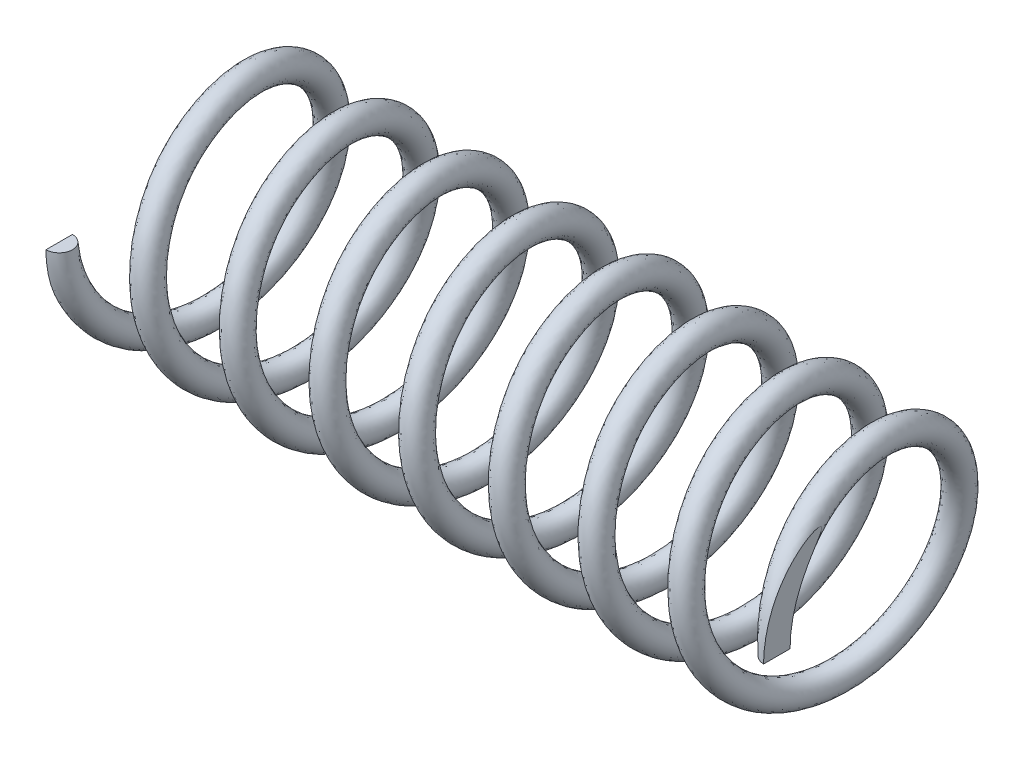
ISO-10303-21;
HEADER;
FILE_DESCRIPTION(('STEP AP214'),'2;1');
FILE_NAME('part.step','',(''),(''),'','','');
FILE_SCHEMA(('AUTOMOTIVE_DESIGN { 1 0 10303 214 1 1 1 1 }'));
ENDSEC;
DATA;
#1=APPLICATION_CONTEXT('core data for automotive mechanical design processes');
#2=APPLICATION_PROTOCOL_DEFINITION('international standard','automotive_design',2000,#1);
#3=PRODUCT_CONTEXT('',#1,'mechanical');
#4=PRODUCT('Part','Part','',(#3));
#5=PRODUCT_RELATED_PRODUCT_CATEGORY('part','',(#4));
#6=PRODUCT_DEFINITION_FORMATION('','',#4);
#7=PRODUCT_DEFINITION_CONTEXT('part definition',#1,'design');
#8=PRODUCT_DEFINITION('design','',#6,#7);
#9=PRODUCT_DEFINITION_SHAPE('','',#8);
#10=(LENGTH_UNIT() NAMED_UNIT(*) SI_UNIT(.MILLI.,.METRE.));
#11=(NAMED_UNIT(*) PLANE_ANGLE_UNIT() SI_UNIT($,.RADIAN.));
#12=(NAMED_UNIT(*) SI_UNIT($,.STERADIAN.) SOLID_ANGLE_UNIT());
#13=UNCERTAINTY_MEASURE_WITH_UNIT(LENGTH_MEASURE(1.E-05),#10,'distance_accuracy_value','');
#14=(GEOMETRIC_REPRESENTATION_CONTEXT(3) GLOBAL_UNCERTAINTY_ASSIGNED_CONTEXT((#13)) GLOBAL_UNIT_ASSIGNED_CONTEXT((#10,
#11,#12)) REPRESENTATION_CONTEXT('',''));
#15=CARTESIAN_POINT('',(0.,0.,0.));
#16=DIRECTION('',(0.,0.,1.));
#17=DIRECTION('',(1.,0.,0.));
#18=AXIS2_PLACEMENT_3D('',#15,#16,#17);
#19=CARTESIAN_POINT('',(0.,0.,7.62));
#20=DIRECTION('',(0.,1.,0.));
#21=DIRECTION('',(0.,0.,1.));
#22=AXIS2_PLACEMENT_3D('',#19,#20,#21);
#23=PLANE('',#22);
#24=CARTESIAN_POINT('',(0.,0.,7.62));
#25=DIRECTION('',(0.,1.,0.));
#26=DIRECTION('',(0.,0.,1.));
#27=AXIS2_PLACEMENT_3D('',#24,#25,#26);
#28=CIRCLE('',#27,0.889);
#29=CARTESIAN_POINT('',(0.,0.,8.509));
#30=VERTEX_POINT('',#29);
#31=CARTESIAN_POINT('',(0.,0.,6.731));
#32=VERTEX_POINT('',#31);
#33=EDGE_CURVE('E71',#30,#32,#28,.T.);
#34=ORIENTED_EDGE('',*,*,#33,.T.);
#35=DIRECTION('',(0.,0.,1.));
#36=VECTOR('',#35,1.);
#37=CARTESIAN_POINT('',(0.,0.,7.62));
#38=LINE('',#37,#36);
#39=EDGE_CURVE('E49',#32,#30,#38,.T.);
#40=ORIENTED_EDGE('',*,*,#39,.T.);
#41=EDGE_LOOP('',(#34,#40));
#42=FACE_BOUND('',#41,.T.);
#43=ADVANCED_FACE('F32',(#42),#23,.T.);
#44=CARTESIAN_POINT('',(48.26,-8.5136280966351E-13,7.62));
#45=DIRECTION('',(0.,1.,1.1172740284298E-13));
#46=DIRECTION('',(0.,-1.1172740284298E-13,1.));
#47=AXIS2_PLACEMENT_3D('',#44,#45,#46);
#48=PLANE('',#47);
#49=DIRECTION('',(0.,1.1172740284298E-13,-1.));
#50=VECTOR('',#49,1.);
#51=CARTESIAN_POINT('',(48.26,-8.5136280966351E-13,7.62));
#52=LINE('',#51,#50);
#53=CARTESIAN_POINT('',(48.26,-1.73472347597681E-12,8.509));
#54=VERTEX_POINT('',#53);
#55=CARTESIAN_POINT('',(48.26,-7.520371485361E-13,6.731));
#56=VERTEX_POINT('',#55);
#57=EDGE_CURVE('E56',#54,#56,#52,.T.);
#58=ORIENTED_EDGE('',*,*,#57,.F.);
#59=CARTESIAN_POINT('',(48.26,-8.5136280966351E-13,7.62));
#60=DIRECTION('',(0.,1.,1.1172740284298E-13));
#61=DIRECTION('',(0.,-1.1172740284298E-13,1.));
#62=AXIS2_PLACEMENT_3D('',#59,#60,#61);
#63=CIRCLE('',#62,0.889);
#64=EDGE_CURVE('E65',#56,#54,#63,.T.);
#65=ORIENTED_EDGE('',*,*,#64,.F.);
#66=EDGE_LOOP('',(#58,#65));
#67=FACE_BOUND('',#66,.T.);
#68=ADVANCED_FACE('F67',(#67),#48,.F.);
#69=CARTESIAN_POINT('',(0.,0.,8.509));
#70=CARTESIAN_POINT('',(0.502708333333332,-4.91267344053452,8.509));
#71=CARTESIAN_POINT('',(1.00541666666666,-7.36901016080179,4.2545));
#72=CARTESIAN_POINT('',(1.508125,-9.82534688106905,0.));
#73=CARTESIAN_POINT('',(2.01083333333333,-7.36901016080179,-4.2545));
#74=CARTESIAN_POINT('',(2.51354166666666,-4.91267344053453,-8.509));
#75=CARTESIAN_POINT('',(3.01624999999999,0.,-8.509));
#76=CARTESIAN_POINT('',(3.51895833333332,4.91267344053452,-8.509));
#77=CARTESIAN_POINT('',(4.02166666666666,7.36901016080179,-4.2545));
#78=CARTESIAN_POINT('',(4.52437499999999,9.82534688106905,0.));
#79=CARTESIAN_POINT('',(5.02708333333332,7.36901016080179,4.25449999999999));
#80=CARTESIAN_POINT('',(5.52979166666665,4.91267344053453,8.509));
#81=CARTESIAN_POINT('',(6.03249999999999,0.,8.509));
#82=CARTESIAN_POINT('',(6.53520833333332,-4.91267344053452,8.509));
#83=CARTESIAN_POINT('',(7.03791666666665,-7.36901016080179,4.2545));
#84=CARTESIAN_POINT('',(7.54062499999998,-9.82534688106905,0.));
#85=CARTESIAN_POINT('',(8.04333333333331,-7.36901016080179,-4.2545));
#86=CARTESIAN_POINT('',(8.54604166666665,-4.91267344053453,-8.509));
#87=CARTESIAN_POINT('',(9.04874999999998,0.,-8.509));
#88=CARTESIAN_POINT('',(9.55145833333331,4.91267344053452,-8.509));
#89=CARTESIAN_POINT('',(10.0541666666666,7.36901016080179,-4.2545));
#90=CARTESIAN_POINT('',(10.556875,9.82534688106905,0.));
#91=CARTESIAN_POINT('',(11.0595833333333,7.36901016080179,4.25449999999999));
#92=CARTESIAN_POINT('',(11.5622916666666,4.91267344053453,8.509));
#93=CARTESIAN_POINT('',(12.065,0.,8.509));
#94=CARTESIAN_POINT('',(12.5677083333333,-4.91267344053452,8.509));
#95=CARTESIAN_POINT('',(13.0704166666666,-7.36901016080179,4.2545));
#96=CARTESIAN_POINT('',(13.573125,-9.82534688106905,0.));
#97=CARTESIAN_POINT('',(14.0758333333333,-7.36901016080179,-4.2545));
#98=CARTESIAN_POINT('',(14.5785416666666,-4.91267344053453,-8.509));
#99=CARTESIAN_POINT('',(15.08125,0.,-8.509));
#100=CARTESIAN_POINT('',(15.5839583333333,4.91267344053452,-8.509));
#101=CARTESIAN_POINT('',(16.0866666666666,7.36901016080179,-4.2545));
#102=CARTESIAN_POINT('',(16.589375,9.82534688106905,0.));
#103=CARTESIAN_POINT('',(17.0920833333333,7.36901016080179,4.25449999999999));
#104=CARTESIAN_POINT('',(17.5947916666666,4.91267344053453,8.509));
#105=CARTESIAN_POINT('',(18.0975,0.,8.509));
#106=CARTESIAN_POINT('',(18.6002083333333,-4.91267344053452,8.509));
#107=CARTESIAN_POINT('',(19.1029166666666,-7.36901016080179,4.2545));
#108=CARTESIAN_POINT('',(19.605625,-9.82534688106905,0.));
#109=CARTESIAN_POINT('',(20.1083333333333,-7.36901016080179,-4.2545));
#110=CARTESIAN_POINT('',(20.6110416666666,-4.91267344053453,-8.509));
#111=CARTESIAN_POINT('',(21.1137499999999,0.,-8.509));
#112=CARTESIAN_POINT('',(21.6164583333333,4.91267344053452,-8.509));
#113=CARTESIAN_POINT('',(22.1191666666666,7.36901016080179,-4.2545));
#114=CARTESIAN_POINT('',(22.6218749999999,9.82534688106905,0.));
#115=CARTESIAN_POINT('',(23.1245833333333,7.36901016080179,4.25449999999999));
#116=CARTESIAN_POINT('',(23.6272916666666,4.91267344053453,8.509));
#117=CARTESIAN_POINT('',(24.1299999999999,0.,8.509));
#118=CARTESIAN_POINT('',(24.6327083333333,-4.91267344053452,8.509));
#119=CARTESIAN_POINT('',(25.1354166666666,-7.36901016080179,4.2545));
#120=CARTESIAN_POINT('',(25.6381249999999,-9.82534688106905,0.));
#121=CARTESIAN_POINT('',(26.1408333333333,-7.36901016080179,-4.2545));
#122=CARTESIAN_POINT('',(26.6435416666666,-4.91267344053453,-8.509));
#123=CARTESIAN_POINT('',(27.1462499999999,0.,-8.509));
#124=CARTESIAN_POINT('',(27.6489583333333,4.91267344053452,-8.509));
#125=CARTESIAN_POINT('',(28.1516666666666,7.36901016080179,-4.2545));
#126=CARTESIAN_POINT('',(28.6543749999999,9.82534688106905,0.));
#127=CARTESIAN_POINT('',(29.1570833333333,7.36901016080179,4.25449999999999));
#128=CARTESIAN_POINT('',(29.6597916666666,4.91267344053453,8.509));
#129=CARTESIAN_POINT('',(30.1624999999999,0.,8.509));
#130=CARTESIAN_POINT('',(30.6652083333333,-4.91267344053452,8.509));
#131=CARTESIAN_POINT('',(31.1679166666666,-7.36901016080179,4.2545));
#132=CARTESIAN_POINT('',(31.6706249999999,-9.82534688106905,0.));
#133=CARTESIAN_POINT('',(32.1733333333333,-7.36901016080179,-4.2545));
#134=CARTESIAN_POINT('',(32.6760416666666,-4.91267344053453,-8.509));
#135=CARTESIAN_POINT('',(33.1787499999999,0.,-8.509));
#136=CARTESIAN_POINT('',(33.6814583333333,4.91267344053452,-8.509));
#137=CARTESIAN_POINT('',(34.1841666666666,7.36901016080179,-4.2545));
#138=CARTESIAN_POINT('',(34.6868749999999,9.82534688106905,0.));
#139=CARTESIAN_POINT('',(35.1895833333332,7.36901016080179,4.25449999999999));
#140=CARTESIAN_POINT('',(35.6922916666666,4.91267344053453,8.509));
#141=CARTESIAN_POINT('',(36.1949999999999,0.,8.509));
#142=CARTESIAN_POINT('',(36.6977083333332,-4.91267344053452,8.509));
#143=CARTESIAN_POINT('',(37.2004166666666,-7.36901016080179,4.2545));
#144=CARTESIAN_POINT('',(37.7031249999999,-9.82534688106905,0.));
#145=CARTESIAN_POINT('',(38.2058333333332,-7.36901016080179,-4.2545));
#146=CARTESIAN_POINT('',(38.7085416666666,-4.91267344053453,-8.509));
#147=CARTESIAN_POINT('',(39.2112499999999,0.,-8.509));
#148=CARTESIAN_POINT('',(39.7139583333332,4.91267344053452,-8.509));
#149=CARTESIAN_POINT('',(40.2166666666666,7.36901016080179,-4.2545));
#150=CARTESIAN_POINT('',(40.7193749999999,9.82534688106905,0.));
#151=CARTESIAN_POINT('',(41.2220833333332,7.36901016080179,4.25449999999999));
#152=CARTESIAN_POINT('',(41.7247916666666,4.91267344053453,8.509));
#153=CARTESIAN_POINT('',(42.2274999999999,0.,8.509));
#154=CARTESIAN_POINT('',(42.7302083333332,-4.91267344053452,8.509));
#155=CARTESIAN_POINT('',(43.2329166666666,-7.36901016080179,4.2545));
#156=CARTESIAN_POINT('',(43.7356249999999,-9.82534688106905,0.));
#157=CARTESIAN_POINT('',(44.2383333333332,-7.36901016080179,-4.2545));
#158=CARTESIAN_POINT('',(44.7410416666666,-4.91267344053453,-8.509));
#159=CARTESIAN_POINT('',(45.2437499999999,0.,-8.509));
#160=CARTESIAN_POINT('',(45.7464583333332,4.91267344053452,-8.509));
#161=CARTESIAN_POINT('',(46.2491666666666,7.36901016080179,-4.2545));
#162=CARTESIAN_POINT('',(46.7518749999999,9.82534688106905,0.));
#163=CARTESIAN_POINT('',(47.2545833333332,7.36901016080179,4.25449999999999));
#164=CARTESIAN_POINT('',(47.7572916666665,4.91267344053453,8.509));
#165=CARTESIAN_POINT('',(48.2599999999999,0.,8.509));
#166=CARTESIAN_POINT('',(48.7627083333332,-4.91267344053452,8.509));
#167=CARTESIAN_POINT('',(49.2654166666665,-7.36901016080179,4.2545));
#168=CARTESIAN_POINT('',(49.7681249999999,-9.82534688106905,0.));
#169=CARTESIAN_POINT('',(50.2708333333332,-7.36901016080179,-4.2545));
#170=CARTESIAN_POINT('',(50.7735416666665,-4.91267344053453,-8.509));
#171=CARTESIAN_POINT('',(51.2762499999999,0.,-8.509));
#172=CARTESIAN_POINT('',(51.7789583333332,4.91267344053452,-8.509));
#173=CARTESIAN_POINT('',(52.2816666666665,7.36901016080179,-4.2545));
#174=CARTESIAN_POINT('',(52.7843749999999,9.82534688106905,0.));
#175=CARTESIAN_POINT('',(53.2870833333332,7.36901016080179,4.25449999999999));
#176=CARTESIAN_POINT('',(53.7897916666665,4.91267344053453,8.509));
#177=CARTESIAN_POINT('',(54.2924999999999,0.,8.509));
#178=CARTESIAN_POINT('',(1.778,0.,8.509));
#179=CARTESIAN_POINT('',(2.28070833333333,-4.91267344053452,8.509));
#180=CARTESIAN_POINT('',(2.78341666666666,-7.36901016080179,4.2545));
#181=CARTESIAN_POINT('',(3.286125,-9.82534688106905,0.));
#182=CARTESIAN_POINT('',(3.78883333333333,-7.36901016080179,-4.2545));
#183=CARTESIAN_POINT('',(4.29154166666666,-4.91267344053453,-8.509));
#184=CARTESIAN_POINT('',(4.79424999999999,0.,-8.509));
#185=CARTESIAN_POINT('',(5.29695833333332,4.91267344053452,-8.509));
#186=CARTESIAN_POINT('',(5.79966666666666,7.36901016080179,-4.2545));
#187=CARTESIAN_POINT('',(6.30237499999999,9.82534688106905,0.));
#188=CARTESIAN_POINT('',(6.80508333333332,7.36901016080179,4.25449999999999));
#189=CARTESIAN_POINT('',(7.30779166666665,4.91267344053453,8.509));
#190=CARTESIAN_POINT('',(7.81049999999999,0.,8.509));
#191=CARTESIAN_POINT('',(8.31320833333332,-4.91267344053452,8.509));
#192=CARTESIAN_POINT('',(8.81591666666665,-7.36901016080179,4.2545));
#193=CARTESIAN_POINT('',(9.31862499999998,-9.82534688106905,0.));
#194=CARTESIAN_POINT('',(9.82133333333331,-7.36901016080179,-4.2545));
#195=CARTESIAN_POINT('',(10.3240416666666,-4.91267344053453,-8.509));
#196=CARTESIAN_POINT('',(10.82675,0.,-8.509));
#197=CARTESIAN_POINT('',(11.3294583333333,4.91267344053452,-8.509));
#198=CARTESIAN_POINT('',(11.8321666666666,7.36901016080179,-4.2545));
#199=CARTESIAN_POINT('',(12.334875,9.82534688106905,0.));
#200=CARTESIAN_POINT('',(12.8375833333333,7.36901016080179,4.25449999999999));
#201=CARTESIAN_POINT('',(13.3402916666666,4.91267344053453,8.509));
#202=CARTESIAN_POINT('',(13.843,0.,8.509));
#203=CARTESIAN_POINT('',(14.3457083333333,-4.91267344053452,8.509));
#204=CARTESIAN_POINT('',(14.8484166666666,-7.36901016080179,4.2545));
#205=CARTESIAN_POINT('',(15.351125,-9.82534688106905,0.));
#206=CARTESIAN_POINT('',(15.8538333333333,-7.36901016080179,-4.2545));
#207=CARTESIAN_POINT('',(16.3565416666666,-4.91267344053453,-8.509));
#208=CARTESIAN_POINT('',(16.85925,0.,-8.509));
#209=CARTESIAN_POINT('',(17.3619583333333,4.91267344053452,-8.509));
#210=CARTESIAN_POINT('',(17.8646666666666,7.36901016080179,-4.2545));
#211=CARTESIAN_POINT('',(18.367375,9.82534688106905,0.));
#212=CARTESIAN_POINT('',(18.8700833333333,7.36901016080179,4.25449999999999));
#213=CARTESIAN_POINT('',(19.3727916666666,4.91267344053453,8.509));
#214=CARTESIAN_POINT('',(19.8755,0.,8.509));
#215=CARTESIAN_POINT('',(20.3782083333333,-4.91267344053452,8.509));
#216=CARTESIAN_POINT('',(20.8809166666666,-7.36901016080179,4.2545));
#217=CARTESIAN_POINT('',(21.383625,-9.82534688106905,0.));
#218=CARTESIAN_POINT('',(21.8863333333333,-7.36901016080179,-4.2545));
#219=CARTESIAN_POINT('',(22.3890416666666,-4.91267344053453,-8.509));
#220=CARTESIAN_POINT('',(22.8917499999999,0.,-8.509));
#221=CARTESIAN_POINT('',(23.3944583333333,4.91267344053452,-8.509));
#222=CARTESIAN_POINT('',(23.8971666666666,7.36901016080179,-4.2545));
#223=CARTESIAN_POINT('',(24.3998749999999,9.82534688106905,0.));
#224=CARTESIAN_POINT('',(24.9025833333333,7.36901016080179,4.25449999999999));
#225=CARTESIAN_POINT('',(25.4052916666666,4.91267344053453,8.509));
#226=CARTESIAN_POINT('',(25.9079999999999,0.,8.509));
#227=CARTESIAN_POINT('',(26.4107083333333,-4.91267344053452,8.509));
#228=CARTESIAN_POINT('',(26.9134166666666,-7.36901016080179,4.2545));
#229=CARTESIAN_POINT('',(27.4161249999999,-9.82534688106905,0.));
#230=CARTESIAN_POINT('',(27.9188333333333,-7.36901016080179,-4.2545));
#231=CARTESIAN_POINT('',(28.4215416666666,-4.91267344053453,-8.509));
#232=CARTESIAN_POINT('',(28.9242499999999,0.,-8.509));
#233=CARTESIAN_POINT('',(29.4269583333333,4.91267344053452,-8.509));
#234=CARTESIAN_POINT('',(29.9296666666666,7.36901016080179,-4.2545));
#235=CARTESIAN_POINT('',(30.4323749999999,9.82534688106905,0.));
#236=CARTESIAN_POINT('',(30.9350833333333,7.36901016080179,4.25449999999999));
#237=CARTESIAN_POINT('',(31.4377916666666,4.91267344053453,8.509));
#238=CARTESIAN_POINT('',(31.9404999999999,0.,8.509));
#239=CARTESIAN_POINT('',(32.4432083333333,-4.91267344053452,8.509));
#240=CARTESIAN_POINT('',(32.9459166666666,-7.36901016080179,4.2545));
#241=CARTESIAN_POINT('',(33.4486249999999,-9.82534688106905,0.));
#242=CARTESIAN_POINT('',(33.9513333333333,-7.36901016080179,-4.2545));
#243=CARTESIAN_POINT('',(34.4540416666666,-4.91267344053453,-8.509));
#244=CARTESIAN_POINT('',(34.9567499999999,0.,-8.509));
#245=CARTESIAN_POINT('',(35.4594583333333,4.91267344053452,-8.509));
#246=CARTESIAN_POINT('',(35.9621666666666,7.36901016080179,-4.2545));
#247=CARTESIAN_POINT('',(36.4648749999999,9.82534688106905,0.));
#248=CARTESIAN_POINT('',(36.9675833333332,7.36901016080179,4.25449999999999));
#249=CARTESIAN_POINT('',(37.4702916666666,4.91267344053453,8.509));
#250=CARTESIAN_POINT('',(37.9729999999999,0.,8.509));
#251=CARTESIAN_POINT('',(38.4757083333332,-4.91267344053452,8.509));
#252=CARTESIAN_POINT('',(38.9784166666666,-7.36901016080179,4.2545));
#253=CARTESIAN_POINT('',(39.4811249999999,-9.82534688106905,0.));
#254=CARTESIAN_POINT('',(39.9838333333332,-7.36901016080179,-4.2545));
#255=CARTESIAN_POINT('',(40.4865416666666,-4.91267344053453,-8.509));
#256=CARTESIAN_POINT('',(40.9892499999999,0.,-8.509));
#257=CARTESIAN_POINT('',(41.4919583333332,4.91267344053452,-8.509));
#258=CARTESIAN_POINT('',(41.9946666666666,7.36901016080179,-4.2545));
#259=CARTESIAN_POINT('',(42.4973749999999,9.82534688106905,0.));
#260=CARTESIAN_POINT('',(43.0000833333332,7.36901016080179,4.25449999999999));
#261=CARTESIAN_POINT('',(43.5027916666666,4.91267344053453,8.509));
#262=CARTESIAN_POINT('',(44.0054999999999,0.,8.509));
#263=CARTESIAN_POINT('',(44.5082083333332,-4.91267344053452,8.509));
#264=CARTESIAN_POINT('',(45.0109166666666,-7.36901016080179,4.2545));
#265=CARTESIAN_POINT('',(45.5136249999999,-9.82534688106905,0.));
#266=CARTESIAN_POINT('',(46.0163333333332,-7.36901016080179,-4.2545));
#267=CARTESIAN_POINT('',(46.5190416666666,-4.91267344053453,-8.509));
#268=CARTESIAN_POINT('',(47.0217499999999,0.,-8.509));
#269=CARTESIAN_POINT('',(47.5244583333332,4.91267344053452,-8.509));
#270=CARTESIAN_POINT('',(48.0271666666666,7.36901016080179,-4.2545));
#271=CARTESIAN_POINT('',(48.5298749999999,9.82534688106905,0.));
#272=CARTESIAN_POINT('',(49.0325833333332,7.36901016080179,4.25449999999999));
#273=CARTESIAN_POINT('',(49.5352916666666,4.91267344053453,8.509));
#274=CARTESIAN_POINT('',(50.0379999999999,0.,8.509));
#275=CARTESIAN_POINT('',(50.5407083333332,-4.91267344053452,8.509));
#276=CARTESIAN_POINT('',(51.0434166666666,-7.36901016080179,4.2545));
#277=CARTESIAN_POINT('',(51.5461249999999,-9.82534688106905,0.));
#278=CARTESIAN_POINT('',(52.0488333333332,-7.36901016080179,-4.2545));
#279=CARTESIAN_POINT('',(52.5515416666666,-4.91267344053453,-8.509));
#280=CARTESIAN_POINT('',(53.0542499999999,0.,-8.509));
#281=CARTESIAN_POINT('',(53.5569583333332,4.91267344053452,-8.509));
#282=CARTESIAN_POINT('',(54.0596666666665,7.36901016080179,-4.2545));
#283=CARTESIAN_POINT('',(54.5623749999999,9.82534688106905,0.));
#284=CARTESIAN_POINT('',(55.0650833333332,7.36901016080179,4.25449999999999));
#285=CARTESIAN_POINT('',(55.5677916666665,4.91267344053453,8.509));
#286=CARTESIAN_POINT('',(56.0704999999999,0.,8.509));
#287=CARTESIAN_POINT('',(1.778,0.,6.731));
#288=CARTESIAN_POINT('',(2.28070833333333,-3.88614466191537,6.731));
#289=CARTESIAN_POINT('',(2.78341666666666,-5.82921699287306,3.3655));
#290=CARTESIAN_POINT('',(3.286125,-7.77228932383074,0.));
#291=CARTESIAN_POINT('',(3.78883333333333,-5.82921699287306,-3.3655));
#292=CARTESIAN_POINT('',(4.29154166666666,-3.88614466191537,-6.731));
#293=CARTESIAN_POINT('',(4.79424999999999,0.,-6.731));
#294=CARTESIAN_POINT('',(5.29695833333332,3.88614466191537,-6.731));
#295=CARTESIAN_POINT('',(5.79966666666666,5.82921699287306,-3.3655));
#296=CARTESIAN_POINT('',(6.30237499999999,7.77228932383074,0.));
#297=CARTESIAN_POINT('',(6.80508333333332,5.82921699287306,3.3655));
#298=CARTESIAN_POINT('',(7.30779166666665,3.88614466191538,6.731));
#299=CARTESIAN_POINT('',(7.81049999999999,0.,6.731));
#300=CARTESIAN_POINT('',(8.31320833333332,-3.88614466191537,6.731));
#301=CARTESIAN_POINT('',(8.81591666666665,-5.82921699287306,3.3655));
#302=CARTESIAN_POINT('',(9.31862499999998,-7.77228932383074,0.));
#303=CARTESIAN_POINT('',(9.82133333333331,-5.82921699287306,-3.3655));
#304=CARTESIAN_POINT('',(10.3240416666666,-3.88614466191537,-6.731));
#305=CARTESIAN_POINT('',(10.82675,0.,-6.731));
#306=CARTESIAN_POINT('',(11.3294583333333,3.88614466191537,-6.731));
#307=CARTESIAN_POINT('',(11.8321666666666,5.82921699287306,-3.3655));
#308=CARTESIAN_POINT('',(12.334875,7.77228932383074,0.));
#309=CARTESIAN_POINT('',(12.8375833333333,5.82921699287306,3.3655));
#310=CARTESIAN_POINT('',(13.3402916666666,3.88614466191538,6.731));
#311=CARTESIAN_POINT('',(13.843,0.,6.731));
#312=CARTESIAN_POINT('',(14.3457083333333,-3.88614466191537,6.731));
#313=CARTESIAN_POINT('',(14.8484166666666,-5.82921699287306,3.3655));
#314=CARTESIAN_POINT('',(15.351125,-7.77228932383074,0.));
#315=CARTESIAN_POINT('',(15.8538333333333,-5.82921699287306,-3.3655));
#316=CARTESIAN_POINT('',(16.3565416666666,-3.88614466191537,-6.731));
#317=CARTESIAN_POINT('',(16.85925,0.,-6.731));
#318=CARTESIAN_POINT('',(17.3619583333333,3.88614466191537,-6.731));
#319=CARTESIAN_POINT('',(17.8646666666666,5.82921699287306,-3.3655));
#320=CARTESIAN_POINT('',(18.367375,7.77228932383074,0.));
#321=CARTESIAN_POINT('',(18.8700833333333,5.82921699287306,3.3655));
#322=CARTESIAN_POINT('',(19.3727916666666,3.88614466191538,6.731));
#323=CARTESIAN_POINT('',(19.8755,0.,6.731));
#324=CARTESIAN_POINT('',(20.3782083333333,-3.88614466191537,6.731));
#325=CARTESIAN_POINT('',(20.8809166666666,-5.82921699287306,3.3655));
#326=CARTESIAN_POINT('',(21.383625,-7.77228932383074,0.));
#327=CARTESIAN_POINT('',(21.8863333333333,-5.82921699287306,-3.3655));
#328=CARTESIAN_POINT('',(22.3890416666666,-3.88614466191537,-6.731));
#329=CARTESIAN_POINT('',(22.8917499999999,0.,-6.731));
#330=CARTESIAN_POINT('',(23.3944583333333,3.88614466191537,-6.731));
#331=CARTESIAN_POINT('',(23.8971666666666,5.82921699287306,-3.3655));
#332=CARTESIAN_POINT('',(24.3998749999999,7.77228932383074,0.));
#333=CARTESIAN_POINT('',(24.9025833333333,5.82921699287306,3.3655));
#334=CARTESIAN_POINT('',(25.4052916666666,3.88614466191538,6.731));
#335=CARTESIAN_POINT('',(25.9079999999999,0.,6.731));
#336=CARTESIAN_POINT('',(26.4107083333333,-3.88614466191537,6.731));
#337=CARTESIAN_POINT('',(26.9134166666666,-5.82921699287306,3.3655));
#338=CARTESIAN_POINT('',(27.4161249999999,-7.77228932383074,0.));
#339=CARTESIAN_POINT('',(27.9188333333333,-5.82921699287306,-3.3655));
#340=CARTESIAN_POINT('',(28.4215416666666,-3.88614466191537,-6.731));
#341=CARTESIAN_POINT('',(28.9242499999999,0.,-6.731));
#342=CARTESIAN_POINT('',(29.4269583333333,3.88614466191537,-6.731));
#343=CARTESIAN_POINT('',(29.9296666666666,5.82921699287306,-3.3655));
#344=CARTESIAN_POINT('',(30.4323749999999,7.77228932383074,0.));
#345=CARTESIAN_POINT('',(30.9350833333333,5.82921699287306,3.3655));
#346=CARTESIAN_POINT('',(31.4377916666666,3.88614466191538,6.731));
#347=CARTESIAN_POINT('',(31.9404999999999,0.,6.731));
#348=CARTESIAN_POINT('',(32.4432083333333,-3.88614466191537,6.731));
#349=CARTESIAN_POINT('',(32.9459166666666,-5.82921699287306,3.3655));
#350=CARTESIAN_POINT('',(33.4486249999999,-7.77228932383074,0.));
#351=CARTESIAN_POINT('',(33.9513333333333,-5.82921699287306,-3.3655));
#352=CARTESIAN_POINT('',(34.4540416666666,-3.88614466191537,-6.731));
#353=CARTESIAN_POINT('',(34.9567499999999,0.,-6.731));
#354=CARTESIAN_POINT('',(35.4594583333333,3.88614466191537,-6.731));
#355=CARTESIAN_POINT('',(35.9621666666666,5.82921699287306,-3.3655));
#356=CARTESIAN_POINT('',(36.4648749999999,7.77228932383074,0.));
#357=CARTESIAN_POINT('',(36.9675833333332,5.82921699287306,3.3655));
#358=CARTESIAN_POINT('',(37.4702916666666,3.88614466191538,6.731));
#359=CARTESIAN_POINT('',(37.9729999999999,0.,6.731));
#360=CARTESIAN_POINT('',(38.4757083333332,-3.88614466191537,6.731));
#361=CARTESIAN_POINT('',(38.9784166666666,-5.82921699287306,3.3655));
#362=CARTESIAN_POINT('',(39.4811249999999,-7.77228932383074,0.));
#363=CARTESIAN_POINT('',(39.9838333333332,-5.82921699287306,-3.3655));
#364=CARTESIAN_POINT('',(40.4865416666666,-3.88614466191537,-6.731));
#365=CARTESIAN_POINT('',(40.9892499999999,0.,-6.731));
#366=CARTESIAN_POINT('',(41.4919583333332,3.88614466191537,-6.731));
#367=CARTESIAN_POINT('',(41.9946666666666,5.82921699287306,-3.3655));
#368=CARTESIAN_POINT('',(42.4973749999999,7.77228932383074,0.));
#369=CARTESIAN_POINT('',(43.0000833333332,5.82921699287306,3.3655));
#370=CARTESIAN_POINT('',(43.5027916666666,3.88614466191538,6.731));
#371=CARTESIAN_POINT('',(44.0054999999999,0.,6.731));
#372=CARTESIAN_POINT('',(44.5082083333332,-3.88614466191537,6.731));
#373=CARTESIAN_POINT('',(45.0109166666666,-5.82921699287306,3.3655));
#374=CARTESIAN_POINT('',(45.5136249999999,-7.77228932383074,0.));
#375=CARTESIAN_POINT('',(46.0163333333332,-5.82921699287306,-3.3655));
#376=CARTESIAN_POINT('',(46.5190416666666,-3.88614466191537,-6.731));
#377=CARTESIAN_POINT('',(47.0217499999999,0.,-6.731));
#378=CARTESIAN_POINT('',(47.5244583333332,3.88614466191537,-6.731));
#379=CARTESIAN_POINT('',(48.0271666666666,5.82921699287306,-3.3655));
#380=CARTESIAN_POINT('',(48.5298749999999,7.77228932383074,0.));
#381=CARTESIAN_POINT('',(49.0325833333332,5.82921699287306,3.3655));
#382=CARTESIAN_POINT('',(49.5352916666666,3.88614466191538,6.731));
#383=CARTESIAN_POINT('',(50.0379999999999,0.,6.731));
#384=CARTESIAN_POINT('',(50.5407083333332,-3.88614466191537,6.731));
#385=CARTESIAN_POINT('',(51.0434166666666,-5.82921699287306,3.3655));
#386=CARTESIAN_POINT('',(51.5461249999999,-7.77228932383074,0.));
#387=CARTESIAN_POINT('',(52.0488333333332,-5.82921699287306,-3.3655));
#388=CARTESIAN_POINT('',(52.5515416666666,-3.88614466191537,-6.731));
#389=CARTESIAN_POINT('',(53.0542499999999,0.,-6.731));
#390=CARTESIAN_POINT('',(53.5569583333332,3.88614466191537,-6.731));
#391=CARTESIAN_POINT('',(54.0596666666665,5.82921699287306,-3.3655));
#392=CARTESIAN_POINT('',(54.5623749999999,7.77228932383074,0.));
#393=CARTESIAN_POINT('',(55.0650833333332,5.82921699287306,3.3655));
#394=CARTESIAN_POINT('',(55.5677916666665,3.88614466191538,6.731));
#395=CARTESIAN_POINT('',(56.0704999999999,0.,6.731));
#396=CARTESIAN_POINT('',(0.,0.,6.731));
#397=CARTESIAN_POINT('',(0.502708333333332,-3.88614466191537,6.731));
#398=CARTESIAN_POINT('',(1.00541666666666,-5.82921699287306,3.3655));
#399=CARTESIAN_POINT('',(1.508125,-7.77228932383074,0.));
#400=CARTESIAN_POINT('',(2.01083333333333,-5.82921699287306,-3.3655));
#401=CARTESIAN_POINT('',(2.51354166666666,-3.88614466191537,-6.731));
#402=CARTESIAN_POINT('',(3.01624999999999,0.,-6.731));
#403=CARTESIAN_POINT('',(3.51895833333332,3.88614466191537,-6.731));
#404=CARTESIAN_POINT('',(4.02166666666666,5.82921699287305,-3.3655));
#405=CARTESIAN_POINT('',(4.52437499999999,7.77228932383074,0.));
#406=CARTESIAN_POINT('',(5.02708333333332,5.82921699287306,3.3655));
#407=CARTESIAN_POINT('',(5.52979166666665,3.88614466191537,6.731));
#408=CARTESIAN_POINT('',(6.03249999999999,0.,6.731));
#409=CARTESIAN_POINT('',(6.53520833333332,-3.88614466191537,6.731));
#410=CARTESIAN_POINT('',(7.03791666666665,-5.82921699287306,3.3655));
#411=CARTESIAN_POINT('',(7.54062499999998,-7.77228932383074,0.));
#412=CARTESIAN_POINT('',(8.04333333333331,-5.82921699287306,-3.3655));
#413=CARTESIAN_POINT('',(8.54604166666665,-3.88614466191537,-6.731));
#414=CARTESIAN_POINT('',(9.04874999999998,0.,-6.731));
#415=CARTESIAN_POINT('',(9.55145833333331,3.88614466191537,-6.731));
#416=CARTESIAN_POINT('',(10.0541666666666,5.82921699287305,-3.3655));
#417=CARTESIAN_POINT('',(10.556875,7.77228932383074,0.));
#418=CARTESIAN_POINT('',(11.0595833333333,5.82921699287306,3.3655));
#419=CARTESIAN_POINT('',(11.5622916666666,3.88614466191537,6.731));
#420=CARTESIAN_POINT('',(12.065,0.,6.731));
#421=CARTESIAN_POINT('',(12.5677083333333,-3.88614466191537,6.731));
#422=CARTESIAN_POINT('',(13.0704166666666,-5.82921699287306,3.3655));
#423=CARTESIAN_POINT('',(13.573125,-7.77228932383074,0.));
#424=CARTESIAN_POINT('',(14.0758333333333,-5.82921699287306,-3.3655));
#425=CARTESIAN_POINT('',(14.5785416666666,-3.88614466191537,-6.731));
#426=CARTESIAN_POINT('',(15.08125,0.,-6.731));
#427=CARTESIAN_POINT('',(15.5839583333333,3.88614466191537,-6.731));
#428=CARTESIAN_POINT('',(16.0866666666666,5.82921699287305,-3.3655));
#429=CARTESIAN_POINT('',(16.589375,7.77228932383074,0.));
#430=CARTESIAN_POINT('',(17.0920833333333,5.82921699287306,3.3655));
#431=CARTESIAN_POINT('',(17.5947916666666,3.88614466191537,6.731));
#432=CARTESIAN_POINT('',(18.0975,0.,6.731));
#433=CARTESIAN_POINT('',(18.6002083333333,-3.88614466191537,6.731));
#434=CARTESIAN_POINT('',(19.1029166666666,-5.82921699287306,3.3655));
#435=CARTESIAN_POINT('',(19.605625,-7.77228932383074,0.));
#436=CARTESIAN_POINT('',(20.1083333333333,-5.82921699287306,-3.3655));
#437=CARTESIAN_POINT('',(20.6110416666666,-3.88614466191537,-6.731));
#438=CARTESIAN_POINT('',(21.1137499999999,0.,-6.731));
#439=CARTESIAN_POINT('',(21.6164583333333,3.88614466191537,-6.731));
#440=CARTESIAN_POINT('',(22.1191666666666,5.82921699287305,-3.3655));
#441=CARTESIAN_POINT('',(22.6218749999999,7.77228932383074,0.));
#442=CARTESIAN_POINT('',(23.1245833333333,5.82921699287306,3.3655));
#443=CARTESIAN_POINT('',(23.6272916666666,3.88614466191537,6.731));
#444=CARTESIAN_POINT('',(24.1299999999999,0.,6.731));
#445=CARTESIAN_POINT('',(24.6327083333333,-3.88614466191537,6.731));
#446=CARTESIAN_POINT('',(25.1354166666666,-5.82921699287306,3.3655));
#447=CARTESIAN_POINT('',(25.6381249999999,-7.77228932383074,0.));
#448=CARTESIAN_POINT('',(26.1408333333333,-5.82921699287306,-3.3655));
#449=CARTESIAN_POINT('',(26.6435416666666,-3.88614466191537,-6.731));
#450=CARTESIAN_POINT('',(27.1462499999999,0.,-6.731));
#451=CARTESIAN_POINT('',(27.6489583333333,3.88614466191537,-6.731));
#452=CARTESIAN_POINT('',(28.1516666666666,5.82921699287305,-3.3655));
#453=CARTESIAN_POINT('',(28.6543749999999,7.77228932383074,0.));
#454=CARTESIAN_POINT('',(29.1570833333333,5.82921699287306,3.3655));
#455=CARTESIAN_POINT('',(29.6597916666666,3.88614466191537,6.731));
#456=CARTESIAN_POINT('',(30.1624999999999,0.,6.731));
#457=CARTESIAN_POINT('',(30.6652083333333,-3.88614466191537,6.731));
#458=CARTESIAN_POINT('',(31.1679166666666,-5.82921699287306,3.3655));
#459=CARTESIAN_POINT('',(31.6706249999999,-7.77228932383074,0.));
#460=CARTESIAN_POINT('',(32.1733333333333,-5.82921699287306,-3.3655));
#461=CARTESIAN_POINT('',(32.6760416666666,-3.88614466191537,-6.731));
#462=CARTESIAN_POINT('',(33.1787499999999,0.,-6.731));
#463=CARTESIAN_POINT('',(33.6814583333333,3.88614466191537,-6.731));
#464=CARTESIAN_POINT('',(34.1841666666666,5.82921699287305,-3.3655));
#465=CARTESIAN_POINT('',(34.6868749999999,7.77228932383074,0.));
#466=CARTESIAN_POINT('',(35.1895833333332,5.82921699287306,3.3655));
#467=CARTESIAN_POINT('',(35.6922916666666,3.88614466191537,6.731));
#468=CARTESIAN_POINT('',(36.1949999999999,0.,6.731));
#469=CARTESIAN_POINT('',(36.6977083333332,-3.88614466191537,6.731));
#470=CARTESIAN_POINT('',(37.2004166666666,-5.82921699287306,3.3655));
#471=CARTESIAN_POINT('',(37.7031249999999,-7.77228932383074,0.));
#472=CARTESIAN_POINT('',(38.2058333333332,-5.82921699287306,-3.3655));
#473=CARTESIAN_POINT('',(38.7085416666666,-3.88614466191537,-6.731));
#474=CARTESIAN_POINT('',(39.2112499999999,0.,-6.731));
#475=CARTESIAN_POINT('',(39.7139583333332,3.88614466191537,-6.731));
#476=CARTESIAN_POINT('',(40.2166666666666,5.82921699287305,-3.3655));
#477=CARTESIAN_POINT('',(40.7193749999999,7.77228932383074,0.));
#478=CARTESIAN_POINT('',(41.2220833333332,5.82921699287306,3.3655));
#479=CARTESIAN_POINT('',(41.7247916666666,3.88614466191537,6.731));
#480=CARTESIAN_POINT('',(42.2274999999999,0.,6.731));
#481=CARTESIAN_POINT('',(42.7302083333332,-3.88614466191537,6.731));
#482=CARTESIAN_POINT('',(43.2329166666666,-5.82921699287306,3.3655));
#483=CARTESIAN_POINT('',(43.7356249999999,-7.77228932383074,0.));
#484=CARTESIAN_POINT('',(44.2383333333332,-5.82921699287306,-3.3655));
#485=CARTESIAN_POINT('',(44.7410416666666,-3.88614466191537,-6.731));
#486=CARTESIAN_POINT('',(45.2437499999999,0.,-6.731));
#487=CARTESIAN_POINT('',(45.7464583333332,3.88614466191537,-6.731));
#488=CARTESIAN_POINT('',(46.2491666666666,5.82921699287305,-3.3655));
#489=CARTESIAN_POINT('',(46.7518749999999,7.77228932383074,0.));
#490=CARTESIAN_POINT('',(47.2545833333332,5.82921699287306,3.3655));
#491=CARTESIAN_POINT('',(47.7572916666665,3.88614466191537,6.731));
#492=CARTESIAN_POINT('',(48.2599999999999,0.,6.731));
#493=CARTESIAN_POINT('',(48.7627083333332,-3.88614466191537,6.731));
#494=CARTESIAN_POINT('',(49.2654166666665,-5.82921699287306,3.3655));
#495=CARTESIAN_POINT('',(49.7681249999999,-7.77228932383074,0.));
#496=CARTESIAN_POINT('',(50.2708333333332,-5.82921699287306,-3.3655));
#497=CARTESIAN_POINT('',(50.7735416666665,-3.88614466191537,-6.731));
#498=CARTESIAN_POINT('',(51.2762499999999,0.,-6.731));
#499=CARTESIAN_POINT('',(51.7789583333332,3.88614466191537,-6.731));
#500=CARTESIAN_POINT('',(52.2816666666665,5.82921699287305,-3.3655));
#501=CARTESIAN_POINT('',(52.7843749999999,7.77228932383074,0.));
#502=CARTESIAN_POINT('',(53.2870833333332,5.82921699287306,3.3655));
#503=CARTESIAN_POINT('',(53.7897916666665,3.88614466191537,6.731));
#504=CARTESIAN_POINT('',(54.2924999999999,0.,6.731));
#505=CARTESIAN_POINT('',(-1.778,0.,6.731));
#506=CARTESIAN_POINT('',(-1.27529166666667,-3.88614466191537,6.731));
#507=CARTESIAN_POINT('',(-0.772583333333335,-5.82921699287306,3.3655));
#508=CARTESIAN_POINT('',(-0.269875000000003,-7.77228932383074,0.));
#509=CARTESIAN_POINT('',(0.232833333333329,-5.82921699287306,-3.3655));
#510=CARTESIAN_POINT('',(0.735541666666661,-3.88614466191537,-6.731));
#511=CARTESIAN_POINT('',(1.23824999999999,0.,-6.731));
#512=CARTESIAN_POINT('',(1.74095833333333,3.88614466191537,-6.731));
#513=CARTESIAN_POINT('',(2.24366666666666,5.82921699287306,-3.3655));
#514=CARTESIAN_POINT('',(2.74637499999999,7.77228932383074,0.));
#515=CARTESIAN_POINT('',(3.24908333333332,5.82921699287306,3.3655));
#516=CARTESIAN_POINT('',(3.75179166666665,3.88614466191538,6.731));
#517=CARTESIAN_POINT('',(4.25449999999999,0.,6.731));
#518=CARTESIAN_POINT('',(4.75720833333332,-3.88614466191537,6.731));
#519=CARTESIAN_POINT('',(5.25991666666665,-5.82921699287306,3.3655));
#520=CARTESIAN_POINT('',(5.76262499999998,-7.77228932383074,0.));
#521=CARTESIAN_POINT('',(6.26533333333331,-5.82921699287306,-3.3655));
#522=CARTESIAN_POINT('',(6.76804166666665,-3.88614466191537,-6.731));
#523=CARTESIAN_POINT('',(7.27074999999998,0.,-6.731));
#524=CARTESIAN_POINT('',(7.77345833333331,3.88614466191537,-6.731));
#525=CARTESIAN_POINT('',(8.27616666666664,5.82921699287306,-3.3655));
#526=CARTESIAN_POINT('',(8.77887499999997,7.77228932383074,0.));
#527=CARTESIAN_POINT('',(9.28158333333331,5.82921699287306,3.3655));
#528=CARTESIAN_POINT('',(9.78429166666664,3.88614466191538,6.731));
#529=CARTESIAN_POINT('',(10.287,0.,6.731));
#530=CARTESIAN_POINT('',(10.7897083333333,-3.88614466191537,6.731));
#531=CARTESIAN_POINT('',(11.2924166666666,-5.82921699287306,3.3655));
#532=CARTESIAN_POINT('',(11.795125,-7.77228932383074,0.));
#533=CARTESIAN_POINT('',(12.2978333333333,-5.82921699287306,-3.3655));
#534=CARTESIAN_POINT('',(12.8005416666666,-3.88614466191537,-6.731));
#535=CARTESIAN_POINT('',(13.30325,0.,-6.731));
#536=CARTESIAN_POINT('',(13.8059583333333,3.88614466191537,-6.731));
#537=CARTESIAN_POINT('',(14.3086666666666,5.82921699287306,-3.3655));
#538=CARTESIAN_POINT('',(14.811375,7.77228932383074,0.));
#539=CARTESIAN_POINT('',(15.3140833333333,5.82921699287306,3.3655));
#540=CARTESIAN_POINT('',(15.8167916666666,3.88614466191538,6.731));
#541=CARTESIAN_POINT('',(16.3195,0.,6.731));
#542=CARTESIAN_POINT('',(16.8222083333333,-3.88614466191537,6.731));
#543=CARTESIAN_POINT('',(17.3249166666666,-5.82921699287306,3.3655));
#544=CARTESIAN_POINT('',(17.827625,-7.77228932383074,0.));
#545=CARTESIAN_POINT('',(18.3303333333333,-5.82921699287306,-3.3655));
#546=CARTESIAN_POINT('',(18.8330416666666,-3.88614466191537,-6.731));
#547=CARTESIAN_POINT('',(19.33575,0.,-6.731));
#548=CARTESIAN_POINT('',(19.8384583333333,3.88614466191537,-6.731));
#549=CARTESIAN_POINT('',(20.3411666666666,5.82921699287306,-3.3655));
#550=CARTESIAN_POINT('',(20.843875,7.77228932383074,0.));
#551=CARTESIAN_POINT('',(21.3465833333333,5.82921699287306,3.3655));
#552=CARTESIAN_POINT('',(21.8492916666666,3.88614466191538,6.731));
#553=CARTESIAN_POINT('',(22.3519999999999,0.,6.731));
#554=CARTESIAN_POINT('',(22.8547083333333,-3.88614466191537,6.731));
#555=CARTESIAN_POINT('',(23.3574166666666,-5.82921699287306,3.3655));
#556=CARTESIAN_POINT('',(23.8601249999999,-7.77228932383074,0.));
#557=CARTESIAN_POINT('',(24.3628333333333,-5.82921699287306,-3.3655));
#558=CARTESIAN_POINT('',(24.8655416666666,-3.88614466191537,-6.731));
#559=CARTESIAN_POINT('',(25.3682499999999,0.,-6.731));
#560=CARTESIAN_POINT('',(25.8709583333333,3.88614466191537,-6.731));
#561=CARTESIAN_POINT('',(26.3736666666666,5.82921699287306,-3.3655));
#562=CARTESIAN_POINT('',(26.8763749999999,7.77228932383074,0.));
#563=CARTESIAN_POINT('',(27.3790833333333,5.82921699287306,3.3655));
#564=CARTESIAN_POINT('',(27.8817916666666,3.88614466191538,6.731));
#565=CARTESIAN_POINT('',(28.3844999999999,0.,6.731));
#566=CARTESIAN_POINT('',(28.8872083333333,-3.88614466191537,6.731));
#567=CARTESIAN_POINT('',(29.3899166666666,-5.82921699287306,3.3655));
#568=CARTESIAN_POINT('',(29.8926249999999,-7.77228932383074,0.));
#569=CARTESIAN_POINT('',(30.3953333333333,-5.82921699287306,-3.3655));
#570=CARTESIAN_POINT('',(30.8980416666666,-3.88614466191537,-6.731));
#571=CARTESIAN_POINT('',(31.4007499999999,0.,-6.731));
#572=CARTESIAN_POINT('',(31.9034583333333,3.88614466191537,-6.731));
#573=CARTESIAN_POINT('',(32.4061666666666,5.82921699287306,-3.3655));
#574=CARTESIAN_POINT('',(32.9088749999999,7.77228932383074,0.));
#575=CARTESIAN_POINT('',(33.4115833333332,5.82921699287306,3.3655));
#576=CARTESIAN_POINT('',(33.9142916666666,3.88614466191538,6.731));
#577=CARTESIAN_POINT('',(34.4169999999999,0.,6.731));
#578=CARTESIAN_POINT('',(34.9197083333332,-3.88614466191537,6.731));
#579=CARTESIAN_POINT('',(35.4224166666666,-5.82921699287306,3.3655));
#580=CARTESIAN_POINT('',(35.9251249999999,-7.77228932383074,0.));
#581=CARTESIAN_POINT('',(36.4278333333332,-5.82921699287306,-3.3655));
#582=CARTESIAN_POINT('',(36.9305416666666,-3.88614466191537,-6.731));
#583=CARTESIAN_POINT('',(37.4332499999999,0.,-6.731));
#584=CARTESIAN_POINT('',(37.9359583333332,3.88614466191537,-6.731));
#585=CARTESIAN_POINT('',(38.4386666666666,5.82921699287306,-3.3655));
#586=CARTESIAN_POINT('',(38.9413749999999,7.77228932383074,0.));
#587=CARTESIAN_POINT('',(39.4440833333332,5.82921699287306,3.3655));
#588=CARTESIAN_POINT('',(39.9467916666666,3.88614466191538,6.731));
#589=CARTESIAN_POINT('',(40.4494999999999,0.,6.731));
#590=CARTESIAN_POINT('',(40.9522083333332,-3.88614466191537,6.731));
#591=CARTESIAN_POINT('',(41.4549166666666,-5.82921699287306,3.3655));
#592=CARTESIAN_POINT('',(41.9576249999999,-7.77228932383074,0.));
#593=CARTESIAN_POINT('',(42.4603333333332,-5.82921699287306,-3.3655));
#594=CARTESIAN_POINT('',(42.9630416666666,-3.88614466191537,-6.731));
#595=CARTESIAN_POINT('',(43.4657499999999,0.,-6.731));
#596=CARTESIAN_POINT('',(43.9684583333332,3.88614466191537,-6.731));
#597=CARTESIAN_POINT('',(44.4711666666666,5.82921699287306,-3.3655));
#598=CARTESIAN_POINT('',(44.9738749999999,7.77228932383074,0.));
#599=CARTESIAN_POINT('',(45.4765833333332,5.82921699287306,3.3655));
#600=CARTESIAN_POINT('',(45.9792916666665,3.88614466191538,6.731));
#601=CARTESIAN_POINT('',(46.4819999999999,0.,6.731));
#602=CARTESIAN_POINT('',(46.9847083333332,-3.88614466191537,6.731));
#603=CARTESIAN_POINT('',(47.4874166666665,-5.82921699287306,3.3655));
#604=CARTESIAN_POINT('',(47.9901249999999,-7.77228932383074,0.));
#605=CARTESIAN_POINT('',(48.4928333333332,-5.82921699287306,-3.3655));
#606=CARTESIAN_POINT('',(48.9955416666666,-3.88614466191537,-6.731));
#607=CARTESIAN_POINT('',(49.4982499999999,0.,-6.731));
#608=CARTESIAN_POINT('',(50.0009583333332,3.88614466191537,-6.731));
#609=CARTESIAN_POINT('',(50.5036666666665,5.82921699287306,-3.3655));
#610=CARTESIAN_POINT('',(51.0063749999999,7.77228932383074,0.));
#611=CARTESIAN_POINT('',(51.5090833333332,5.82921699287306,3.3655));
#612=CARTESIAN_POINT('',(52.0117916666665,3.88614466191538,6.731));
#613=CARTESIAN_POINT('',(52.5144999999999,0.,6.731));
#614=CARTESIAN_POINT('',(-1.778,0.,8.509));
#615=CARTESIAN_POINT('',(-1.27529166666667,-4.91267344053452,8.509));
#616=CARTESIAN_POINT('',(-0.772583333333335,-7.36901016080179,4.2545));
#617=CARTESIAN_POINT('',(-0.269875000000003,-9.82534688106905,0.));
#618=CARTESIAN_POINT('',(0.232833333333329,-7.36901016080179,-4.2545));
#619=CARTESIAN_POINT('',(0.735541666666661,-4.91267344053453,-8.509));
#620=CARTESIAN_POINT('',(1.23824999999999,0.,-8.509));
#621=CARTESIAN_POINT('',(1.74095833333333,4.91267344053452,-8.509));
#622=CARTESIAN_POINT('',(2.24366666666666,7.36901016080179,-4.2545));
#623=CARTESIAN_POINT('',(2.74637499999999,9.82534688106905,0.));
#624=CARTESIAN_POINT('',(3.24908333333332,7.36901016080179,4.25449999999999));
#625=CARTESIAN_POINT('',(3.75179166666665,4.91267344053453,8.509));
#626=CARTESIAN_POINT('',(4.25449999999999,0.,8.509));
#627=CARTESIAN_POINT('',(4.75720833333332,-4.91267344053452,8.509));
#628=CARTESIAN_POINT('',(5.25991666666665,-7.36901016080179,4.2545));
#629=CARTESIAN_POINT('',(5.76262499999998,-9.82534688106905,0.));
#630=CARTESIAN_POINT('',(6.26533333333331,-7.36901016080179,-4.2545));
#631=CARTESIAN_POINT('',(6.76804166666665,-4.91267344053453,-8.509));
#632=CARTESIAN_POINT('',(7.27074999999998,0.,-8.509));
#633=CARTESIAN_POINT('',(7.77345833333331,4.91267344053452,-8.509));
#634=CARTESIAN_POINT('',(8.27616666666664,7.36901016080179,-4.2545));
#635=CARTESIAN_POINT('',(8.77887499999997,9.82534688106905,0.));
#636=CARTESIAN_POINT('',(9.28158333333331,7.36901016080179,4.25449999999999));
#637=CARTESIAN_POINT('',(9.78429166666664,4.91267344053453,8.509));
#638=CARTESIAN_POINT('',(10.287,0.,8.509));
#639=CARTESIAN_POINT('',(10.7897083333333,-4.91267344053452,8.509));
#640=CARTESIAN_POINT('',(11.2924166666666,-7.36901016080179,4.2545));
#641=CARTESIAN_POINT('',(11.795125,-9.82534688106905,0.));
#642=CARTESIAN_POINT('',(12.2978333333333,-7.36901016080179,-4.2545));
#643=CARTESIAN_POINT('',(12.8005416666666,-4.91267344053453,-8.509));
#644=CARTESIAN_POINT('',(13.30325,0.,-8.509));
#645=CARTESIAN_POINT('',(13.8059583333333,4.91267344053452,-8.509));
#646=CARTESIAN_POINT('',(14.3086666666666,7.36901016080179,-4.2545));
#647=CARTESIAN_POINT('',(14.811375,9.82534688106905,0.));
#648=CARTESIAN_POINT('',(15.3140833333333,7.36901016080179,4.25449999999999));
#649=CARTESIAN_POINT('',(15.8167916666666,4.91267344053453,8.509));
#650=CARTESIAN_POINT('',(16.3195,0.,8.509));
#651=CARTESIAN_POINT('',(16.8222083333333,-4.91267344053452,8.509));
#652=CARTESIAN_POINT('',(17.3249166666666,-7.36901016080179,4.2545));
#653=CARTESIAN_POINT('',(17.827625,-9.82534688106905,0.));
#654=CARTESIAN_POINT('',(18.3303333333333,-7.36901016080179,-4.2545));
#655=CARTESIAN_POINT('',(18.8330416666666,-4.91267344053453,-8.509));
#656=CARTESIAN_POINT('',(19.33575,0.,-8.509));
#657=CARTESIAN_POINT('',(19.8384583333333,4.91267344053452,-8.509));
#658=CARTESIAN_POINT('',(20.3411666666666,7.36901016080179,-4.2545));
#659=CARTESIAN_POINT('',(20.843875,9.82534688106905,0.));
#660=CARTESIAN_POINT('',(21.3465833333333,7.36901016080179,4.25449999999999));
#661=CARTESIAN_POINT('',(21.8492916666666,4.91267344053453,8.509));
#662=CARTESIAN_POINT('',(22.3519999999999,0.,8.509));
#663=CARTESIAN_POINT('',(22.8547083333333,-4.91267344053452,8.509));
#664=CARTESIAN_POINT('',(23.3574166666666,-7.36901016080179,4.2545));
#665=CARTESIAN_POINT('',(23.8601249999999,-9.82534688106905,0.));
#666=CARTESIAN_POINT('',(24.3628333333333,-7.36901016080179,-4.2545));
#667=CARTESIAN_POINT('',(24.8655416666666,-4.91267344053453,-8.509));
#668=CARTESIAN_POINT('',(25.3682499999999,0.,-8.509));
#669=CARTESIAN_POINT('',(25.8709583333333,4.91267344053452,-8.509));
#670=CARTESIAN_POINT('',(26.3736666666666,7.36901016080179,-4.2545));
#671=CARTESIAN_POINT('',(26.8763749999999,9.82534688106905,0.));
#672=CARTESIAN_POINT('',(27.3790833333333,7.36901016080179,4.25449999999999));
#673=CARTESIAN_POINT('',(27.8817916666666,4.91267344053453,8.509));
#674=CARTESIAN_POINT('',(28.3844999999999,0.,8.509));
#675=CARTESIAN_POINT('',(28.8872083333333,-4.91267344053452,8.509));
#676=CARTESIAN_POINT('',(29.3899166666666,-7.36901016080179,4.2545));
#677=CARTESIAN_POINT('',(29.8926249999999,-9.82534688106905,0.));
#678=CARTESIAN_POINT('',(30.3953333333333,-7.36901016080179,-4.2545));
#679=CARTESIAN_POINT('',(30.8980416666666,-4.91267344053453,-8.509));
#680=CARTESIAN_POINT('',(31.4007499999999,0.,-8.509));
#681=CARTESIAN_POINT('',(31.9034583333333,4.91267344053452,-8.509));
#682=CARTESIAN_POINT('',(32.4061666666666,7.36901016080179,-4.2545));
#683=CARTESIAN_POINT('',(32.9088749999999,9.82534688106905,0.));
#684=CARTESIAN_POINT('',(33.4115833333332,7.36901016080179,4.25449999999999));
#685=CARTESIAN_POINT('',(33.9142916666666,4.91267344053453,8.509));
#686=CARTESIAN_POINT('',(34.4169999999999,0.,8.509));
#687=CARTESIAN_POINT('',(34.9197083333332,-4.91267344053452,8.509));
#688=CARTESIAN_POINT('',(35.4224166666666,-7.36901016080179,4.2545));
#689=CARTESIAN_POINT('',(35.9251249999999,-9.82534688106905,0.));
#690=CARTESIAN_POINT('',(36.4278333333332,-7.36901016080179,-4.2545));
#691=CARTESIAN_POINT('',(36.9305416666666,-4.91267344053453,-8.509));
#692=CARTESIAN_POINT('',(37.4332499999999,0.,-8.509));
#693=CARTESIAN_POINT('',(37.9359583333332,4.91267344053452,-8.509));
#694=CARTESIAN_POINT('',(38.4386666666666,7.36901016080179,-4.2545));
#695=CARTESIAN_POINT('',(38.9413749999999,9.82534688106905,0.));
#696=CARTESIAN_POINT('',(39.4440833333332,7.36901016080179,4.25449999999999));
#697=CARTESIAN_POINT('',(39.9467916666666,4.91267344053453,8.509));
#698=CARTESIAN_POINT('',(40.4494999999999,0.,8.509));
#699=CARTESIAN_POINT('',(40.9522083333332,-4.91267344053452,8.509));
#700=CARTESIAN_POINT('',(41.4549166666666,-7.36901016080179,4.2545));
#701=CARTESIAN_POINT('',(41.9576249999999,-9.82534688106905,0.));
#702=CARTESIAN_POINT('',(42.4603333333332,-7.36901016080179,-4.2545));
#703=CARTESIAN_POINT('',(42.9630416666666,-4.91267344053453,-8.509));
#704=CARTESIAN_POINT('',(43.4657499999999,0.,-8.509));
#705=CARTESIAN_POINT('',(43.9684583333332,4.91267344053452,-8.509));
#706=CARTESIAN_POINT('',(44.4711666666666,7.36901016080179,-4.2545));
#707=CARTESIAN_POINT('',(44.9738749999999,9.82534688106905,0.));
#708=CARTESIAN_POINT('',(45.4765833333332,7.36901016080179,4.25449999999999));
#709=CARTESIAN_POINT('',(45.9792916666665,4.91267344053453,8.509));
#710=CARTESIAN_POINT('',(46.4819999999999,0.,8.509));
#711=CARTESIAN_POINT('',(46.9847083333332,-4.91267344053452,8.509));
#712=CARTESIAN_POINT('',(47.4874166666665,-7.36901016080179,4.2545));
#713=CARTESIAN_POINT('',(47.9901249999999,-9.82534688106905,0.));
#714=CARTESIAN_POINT('',(48.4928333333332,-7.36901016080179,-4.2545));
#715=CARTESIAN_POINT('',(48.9955416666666,-4.91267344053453,-8.509));
#716=CARTESIAN_POINT('',(49.4982499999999,0.,-8.509));
#717=CARTESIAN_POINT('',(50.0009583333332,4.91267344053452,-8.509));
#718=CARTESIAN_POINT('',(50.5036666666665,7.36901016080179,-4.2545));
#719=CARTESIAN_POINT('',(51.0063749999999,9.82534688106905,0.));
#720=CARTESIAN_POINT('',(51.5090833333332,7.36901016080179,4.25449999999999));
#721=CARTESIAN_POINT('',(52.0117916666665,4.91267344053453,8.509));
#722=CARTESIAN_POINT('',(52.5144999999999,0.,8.509));
#723=CARTESIAN_POINT('',(0.,0.,8.509));
#724=CARTESIAN_POINT('',(0.502708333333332,-4.91267344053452,8.509));
#725=CARTESIAN_POINT('',(1.00541666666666,-7.36901016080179,4.2545));
#726=CARTESIAN_POINT('',(1.508125,-9.82534688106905,0.));
#727=CARTESIAN_POINT('',(2.01083333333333,-7.36901016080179,-4.2545));
#728=CARTESIAN_POINT('',(2.51354166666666,-4.91267344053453,-8.509));
#729=CARTESIAN_POINT('',(3.01624999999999,0.,-8.509));
#730=CARTESIAN_POINT('',(3.51895833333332,4.91267344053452,-8.509));
#731=CARTESIAN_POINT('',(4.02166666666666,7.36901016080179,-4.2545));
#732=CARTESIAN_POINT('',(4.52437499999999,9.82534688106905,0.));
#733=CARTESIAN_POINT('',(5.02708333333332,7.36901016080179,4.25449999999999));
#734=CARTESIAN_POINT('',(5.52979166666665,4.91267344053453,8.509));
#735=CARTESIAN_POINT('',(6.03249999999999,0.,8.509));
#736=CARTESIAN_POINT('',(6.53520833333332,-4.91267344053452,8.509));
#737=CARTESIAN_POINT('',(7.03791666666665,-7.36901016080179,4.2545));
#738=CARTESIAN_POINT('',(7.54062499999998,-9.82534688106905,0.));
#739=CARTESIAN_POINT('',(8.04333333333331,-7.36901016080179,-4.2545));
#740=CARTESIAN_POINT('',(8.54604166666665,-4.91267344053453,-8.509));
#741=CARTESIAN_POINT('',(9.04874999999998,0.,-8.509));
#742=CARTESIAN_POINT('',(9.55145833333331,4.91267344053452,-8.509));
#743=CARTESIAN_POINT('',(10.0541666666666,7.36901016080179,-4.2545));
#744=CARTESIAN_POINT('',(10.556875,9.82534688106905,0.));
#745=CARTESIAN_POINT('',(11.0595833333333,7.36901016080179,4.25449999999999));
#746=CARTESIAN_POINT('',(11.5622916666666,4.91267344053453,8.509));
#747=CARTESIAN_POINT('',(12.065,0.,8.509));
#748=CARTESIAN_POINT('',(12.5677083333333,-4.91267344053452,8.509));
#749=CARTESIAN_POINT('',(13.0704166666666,-7.36901016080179,4.2545));
#750=CARTESIAN_POINT('',(13.573125,-9.82534688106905,0.));
#751=CARTESIAN_POINT('',(14.0758333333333,-7.36901016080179,-4.2545));
#752=CARTESIAN_POINT('',(14.5785416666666,-4.91267344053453,-8.509));
#753=CARTESIAN_POINT('',(15.08125,0.,-8.509));
#754=CARTESIAN_POINT('',(15.5839583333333,4.91267344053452,-8.509));
#755=CARTESIAN_POINT('',(16.0866666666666,7.36901016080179,-4.2545));
#756=CARTESIAN_POINT('',(16.589375,9.82534688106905,0.));
#757=CARTESIAN_POINT('',(17.0920833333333,7.36901016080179,4.25449999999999));
#758=CARTESIAN_POINT('',(17.5947916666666,4.91267344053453,8.509));
#759=CARTESIAN_POINT('',(18.0975,0.,8.509));
#760=CARTESIAN_POINT('',(18.6002083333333,-4.91267344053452,8.509));
#761=CARTESIAN_POINT('',(19.1029166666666,-7.36901016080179,4.2545));
#762=CARTESIAN_POINT('',(19.605625,-9.82534688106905,0.));
#763=CARTESIAN_POINT('',(20.1083333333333,-7.36901016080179,-4.2545));
#764=CARTESIAN_POINT('',(20.6110416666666,-4.91267344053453,-8.509));
#765=CARTESIAN_POINT('',(21.1137499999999,0.,-8.509));
#766=CARTESIAN_POINT('',(21.6164583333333,4.91267344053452,-8.509));
#767=CARTESIAN_POINT('',(22.1191666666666,7.36901016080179,-4.2545));
#768=CARTESIAN_POINT('',(22.6218749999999,9.82534688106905,0.));
#769=CARTESIAN_POINT('',(23.1245833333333,7.36901016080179,4.25449999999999));
#770=CARTESIAN_POINT('',(23.6272916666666,4.91267344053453,8.509));
#771=CARTESIAN_POINT('',(24.1299999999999,0.,8.509));
#772=CARTESIAN_POINT('',(24.6327083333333,-4.91267344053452,8.509));
#773=CARTESIAN_POINT('',(25.1354166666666,-7.36901016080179,4.2545));
#774=CARTESIAN_POINT('',(25.6381249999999,-9.82534688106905,0.));
#775=CARTESIAN_POINT('',(26.1408333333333,-7.36901016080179,-4.2545));
#776=CARTESIAN_POINT('',(26.6435416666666,-4.91267344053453,-8.509));
#777=CARTESIAN_POINT('',(27.1462499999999,0.,-8.509));
#778=CARTESIAN_POINT('',(27.6489583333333,4.91267344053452,-8.509));
#779=CARTESIAN_POINT('',(28.1516666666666,7.36901016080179,-4.2545));
#780=CARTESIAN_POINT('',(28.6543749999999,9.82534688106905,0.));
#781=CARTESIAN_POINT('',(29.1570833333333,7.36901016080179,4.25449999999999));
#782=CARTESIAN_POINT('',(29.6597916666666,4.91267344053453,8.509));
#783=CARTESIAN_POINT('',(30.1624999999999,0.,8.509));
#784=CARTESIAN_POINT('',(30.6652083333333,-4.91267344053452,8.509));
#785=CARTESIAN_POINT('',(31.1679166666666,-7.36901016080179,4.2545));
#786=CARTESIAN_POINT('',(31.6706249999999,-9.82534688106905,0.));
#787=CARTESIAN_POINT('',(32.1733333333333,-7.36901016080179,-4.2545));
#788=CARTESIAN_POINT('',(32.6760416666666,-4.91267344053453,-8.509));
#789=CARTESIAN_POINT('',(33.1787499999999,0.,-8.509));
#790=CARTESIAN_POINT('',(33.6814583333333,4.91267344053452,-8.509));
#791=CARTESIAN_POINT('',(34.1841666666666,7.36901016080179,-4.2545));
#792=CARTESIAN_POINT('',(34.6868749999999,9.82534688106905,0.));
#793=CARTESIAN_POINT('',(35.1895833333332,7.36901016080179,4.25449999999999));
#794=CARTESIAN_POINT('',(35.6922916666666,4.91267344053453,8.509));
#795=CARTESIAN_POINT('',(36.1949999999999,0.,8.509));
#796=CARTESIAN_POINT('',(36.6977083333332,-4.91267344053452,8.509));
#797=CARTESIAN_POINT('',(37.2004166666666,-7.36901016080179,4.2545));
#798=CARTESIAN_POINT('',(37.7031249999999,-9.82534688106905,0.));
#799=CARTESIAN_POINT('',(38.2058333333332,-7.36901016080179,-4.2545));
#800=CARTESIAN_POINT('',(38.7085416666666,-4.91267344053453,-8.509));
#801=CARTESIAN_POINT('',(39.2112499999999,0.,-8.509));
#802=CARTESIAN_POINT('',(39.7139583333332,4.91267344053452,-8.509));
#803=CARTESIAN_POINT('',(40.2166666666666,7.36901016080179,-4.2545));
#804=CARTESIAN_POINT('',(40.7193749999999,9.82534688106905,0.));
#805=CARTESIAN_POINT('',(41.2220833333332,7.36901016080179,4.25449999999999));
#806=CARTESIAN_POINT('',(41.7247916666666,4.91267344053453,8.509));
#807=CARTESIAN_POINT('',(42.2274999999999,0.,8.509));
#808=CARTESIAN_POINT('',(42.7302083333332,-4.91267344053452,8.509));
#809=CARTESIAN_POINT('',(43.2329166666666,-7.36901016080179,4.2545));
#810=CARTESIAN_POINT('',(43.7356249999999,-9.82534688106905,0.));
#811=CARTESIAN_POINT('',(44.2383333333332,-7.36901016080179,-4.2545));
#812=CARTESIAN_POINT('',(44.7410416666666,-4.91267344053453,-8.509));
#813=CARTESIAN_POINT('',(45.2437499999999,0.,-8.509));
#814=CARTESIAN_POINT('',(45.7464583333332,4.91267344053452,-8.509));
#815=CARTESIAN_POINT('',(46.2491666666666,7.36901016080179,-4.2545));
#816=CARTESIAN_POINT('',(46.7518749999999,9.82534688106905,0.));
#817=CARTESIAN_POINT('',(47.2545833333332,7.36901016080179,4.25449999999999));
#818=CARTESIAN_POINT('',(47.7572916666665,4.91267344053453,8.509));
#819=CARTESIAN_POINT('',(48.2599999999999,0.,8.509));
#820=CARTESIAN_POINT('',(48.7627083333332,-4.91267344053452,8.509));
#821=CARTESIAN_POINT('',(49.2654166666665,-7.36901016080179,4.2545));
#822=CARTESIAN_POINT('',(49.7681249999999,-9.82534688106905,0.));
#823=CARTESIAN_POINT('',(50.2708333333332,-7.36901016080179,-4.2545));
#824=CARTESIAN_POINT('',(50.7735416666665,-4.91267344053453,-8.509));
#825=CARTESIAN_POINT('',(51.2762499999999,0.,-8.509));
#826=CARTESIAN_POINT('',(51.7789583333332,4.91267344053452,-8.509));
#827=CARTESIAN_POINT('',(52.2816666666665,7.36901016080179,-4.2545));
#828=CARTESIAN_POINT('',(52.7843749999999,9.82534688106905,0.));
#829=CARTESIAN_POINT('',(53.2870833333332,7.36901016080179,4.25449999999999));
#830=CARTESIAN_POINT('',(53.7897916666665,4.91267344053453,8.509));
#831=CARTESIAN_POINT('',(54.2924999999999,0.,8.509));
#832=(BOUNDED_SURFACE() B_SPLINE_SURFACE(3,2,((#69,#70,#71,#72,#73,#74,#75,#76,#77,#78,#79,#80,
#81,#82,#83,#84,#85,#86,#87,#88,#89,#90,#91,#92,#93,#94,#95,#96,#97,#98,#99,#100,#101,#102,#103,
#104,#105,#106,#107,#108,#109,#110,#111,#112,#113,#114,#115,#116,#117,#118,#119,#120,#121,#122,
#123,#124,#125,#126,#127,#128,#129,#130,#131,#132,#133,#134,#135,#136,#137,#138,#139,#140,#141,
#142,#143,#144,#145,#146,#147,#148,#149,#150,#151,#152,#153,#154,#155,#156,#157,#158,#159,#160,
#161,#162,#163,#164,#165,#166,#167,#168,#169,#170,#171,#172,#173,#174,#175,#176,#177),(#178,
#179,#180,#181,#182,#183,#184,#185,#186,#187,#188,#189,#190,#191,#192,#193,#194,#195,#196,#197,
#198,#199,#200,#201,#202,#203,#204,#205,#206,#207,#208,#209,#210,#211,#212,#213,#214,#215,#216,
#217,#218,#219,#220,#221,#222,#223,#224,#225,#226,#227,#228,#229,#230,#231,#232,#233,#234,#235,
#236,#237,#238,#239,#240,#241,#242,#243,#244,#245,#246,#247,#248,#249,#250,#251,#252,#253,#254,
#255,#256,#257,#258,#259,#260,#261,#262,#263,#264,#265,#266,#267,#268,#269,#270,#271,#272,#273,
#274,#275,#276,#277,#278,#279,#280,#281,#282,#283,#284,#285,#286),(#287,#288,#289,#290,#291,
#292,#293,#294,#295,#296,#297,#298,#299,#300,#301,#302,#303,#304,#305,#306,#307,#308,#309,#310,
#311,#312,#313,#314,#315,#316,#317,#318,#319,#320,#321,#322,#323,#324,#325,#326,#327,#328,#329,
#330,#331,#332,#333,#334,#335,#336,#337,#338,#339,#340,#341,#342,#343,#344,#345,#346,#347,#348,
#349,#350,#351,#352,#353,#354,#355,#356,#357,#358,#359,#360,#361,#362,#363,#364,#365,#366,#367,
#368,#369,#370,#371,#372,#373,#374,#375,#376,#377,#378,#379,#380,#381,#382,#383,#384,#385,#386,
#387,#388,#389,#390,#391,#392,#393,#394,#395),(#396,#397,#398,#399,#400,#401,#402,#403,#404,
#405,#406,#407,#408,#409,#410,#411,#412,#413,#414,#415,#416,#417,#418,#419,#420,#421,#422,#423,
#424,#425,#426,#427,#428,#429,#430,#431,#432,#433,#434,#435,#436,#437,#438,#439,#440,#441,#442,
#443,#444,#445,#446,#447,#448,#449,#450,#451,#452,#453,#454,#455,#456,#457,#458,#459,#460,#461,
#462,#463,#464,#465,#466,#467,#468,#469,#470,#471,#472,#473,#474,#475,#476,#477,#478,#479,#480,
#481,#482,#483,#484,#485,#486,#487,#488,#489,#490,#491,#492,#493,#494,#495,#496,#497,#498,#499,
#500,#501,#502,#503,#504),(#505,#506,#507,#508,#509,#510,#511,#512,#513,#514,#515,#516,#517,
#518,#519,#520,#521,#522,#523,#524,#525,#526,#527,#528,#529,#530,#531,#532,#533,#534,#535,#536,
#537,#538,#539,#540,#541,#542,#543,#544,#545,#546,#547,#548,#549,#550,#551,#552,#553,#554,#555,
#556,#557,#558,#559,#560,#561,#562,#563,#564,#565,#566,#567,#568,#569,#570,#571,#572,#573,#574,
#575,#576,#577,#578,#579,#580,#581,#582,#583,#584,#585,#586,#587,#588,#589,#590,#591,#592,#593,
#594,#595,#596,#597,#598,#599,#600,#601,#602,#603,#604,#605,#606,#607,#608,#609,#610,#611,#612,
#613),(#614,#615,#616,#617,#618,#619,#620,#621,#622,#623,#624,#625,#626,#627,#628,#629,#630,
#631,#632,#633,#634,#635,#636,#637,#638,#639,#640,#641,#642,#643,#644,#645,#646,#647,#648,#649,
#650,#651,#652,#653,#654,#655,#656,#657,#658,#659,#660,#661,#662,#663,#664,#665,#666,#667,#668,
#669,#670,#671,#672,#673,#674,#675,#676,#677,#678,#679,#680,#681,#682,#683,#684,#685,#686,#687,
#688,#689,#690,#691,#692,#693,#694,#695,#696,#697,#698,#699,#700,#701,#702,#703,#704,#705,#706,
#707,#708,#709,#710,#711,#712,#713,#714,#715,#716,#717,#718,#719,#720,#721,#722),(#723,#724,
#725,#726,#727,#728,#729,#730,#731,#732,#733,#734,#735,#736,#737,#738,#739,#740,#741,#742,#743,
#744,#745,#746,#747,#748,#749,#750,#751,#752,#753,#754,#755,#756,#757,#758,#759,#760,#761,#762,
#763,#764,#765,#766,#767,#768,#769,#770,#771,#772,#773,#774,#775,#776,#777,#778,#779,#780,#781,
#782,#783,#784,#785,#786,#787,#788,#789,#790,#791,#792,#793,#794,#795,#796,#797,#798,#799,#800,
#801,#802,#803,#804,#805,#806,#807,#808,#809,#810,#811,#812,#813,#814,#815,#816,#817,#818,#819,
#820,#821,#822,#823,#824,#825,#826,#827,#828,#829,#830,#831)),.UNSPECIFIED.,.T.,.F.,
.F.) B_SPLINE_SURFACE_WITH_KNOTS((4,3,4),(3,2,2,2,2,2,2,2,2,2,2,2,2,2,2,2,2,2,2,2,2,2,2,2,2,2,2,
2,2,2,2,2,2,2,2,2,2,2,2,2,2,2,2,2,2,2,2,2,2,2,2,2,2,2,3),(0.,0.5,1.),(0.,0.0185185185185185,
0.037037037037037,0.0555555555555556,0.0740740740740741,0.0925925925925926,0.111111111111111,
0.12962962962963,0.148148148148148,0.166666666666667,0.185185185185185,0.203703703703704,
0.222222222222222,0.240740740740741,0.259259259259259,0.277777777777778,0.296296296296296,
0.314814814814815,0.333333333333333,0.351851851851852,0.37037037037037,0.388888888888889,
0.407407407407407,0.425925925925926,0.444444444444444,0.462962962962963,0.481481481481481,0.5,
0.518518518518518,0.537037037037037,0.555555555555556,0.574074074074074,0.592592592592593,
0.611111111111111,0.62962962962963,0.648148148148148,0.666666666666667,0.685185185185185,
0.703703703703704,0.722222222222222,0.740740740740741,0.759259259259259,0.777777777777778,
0.796296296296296,0.814814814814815,0.833333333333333,0.851851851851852,0.87037037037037,
0.888888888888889,0.907407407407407,0.925925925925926,0.944444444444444,0.962962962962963,
0.981481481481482,1.),
.UNSPECIFIED.) GEOMETRIC_REPRESENTATION_ITEM() RATIONAL_B_SPLINE_SURFACE(((1.,0.866025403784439,
1.,0.866025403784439,1.,0.866025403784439,1.,0.866025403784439,1.,0.866025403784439,1.,
0.866025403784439,1.,0.866025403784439,1.,0.866025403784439,1.,0.866025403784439,1.,
0.866025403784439,1.,0.866025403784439,1.,0.866025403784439,1.,0.866025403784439,1.,
0.866025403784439,1.,0.866025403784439,1.,0.866025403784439,1.,0.866025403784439,1.,
0.866025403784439,1.,0.866025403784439,1.,0.866025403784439,1.,0.866025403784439,1.,
0.866025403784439,1.,0.866025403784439,1.,0.866025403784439,1.,0.866025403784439,1.,
0.866025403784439,1.,0.866025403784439,1.,0.866025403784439,1.,0.866025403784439,1.,
0.866025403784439,1.,0.866025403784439,1.,0.866025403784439,1.,0.866025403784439,1.,
0.866025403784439,1.,0.866025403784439,1.,0.866025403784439,1.,0.866025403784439,1.,
0.866025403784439,1.,0.866025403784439,1.,0.866025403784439,1.,0.866025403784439,1.,
0.866025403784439,1.,0.866025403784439,1.,0.866025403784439,1.,0.866025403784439,1.,
0.866025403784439,1.,0.866025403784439,1.,0.866025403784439,1.,0.866025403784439,1.,
0.866025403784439,1.,0.866025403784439,1.,0.866025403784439,1.,0.866025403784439,1.,
0.866025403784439,1.),(0.333333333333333,0.288675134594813,0.333333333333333,0.288675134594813,
0.333333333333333,0.288675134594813,0.333333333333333,0.288675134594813,0.333333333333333,
0.288675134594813,0.333333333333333,0.288675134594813,0.333333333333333,0.288675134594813,
0.333333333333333,0.288675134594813,0.333333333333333,0.288675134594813,0.333333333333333,
0.288675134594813,0.333333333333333,0.288675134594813,0.333333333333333,0.288675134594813,
0.333333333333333,0.288675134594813,0.333333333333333,0.288675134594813,0.333333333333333,
0.288675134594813,0.333333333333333,0.288675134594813,0.333333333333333,0.288675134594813,
0.333333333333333,0.288675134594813,0.333333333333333,0.288675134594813,0.333333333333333,
0.288675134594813,0.333333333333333,0.288675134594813,0.333333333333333,0.288675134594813,
0.333333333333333,0.288675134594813,0.333333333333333,0.288675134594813,0.333333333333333,
0.288675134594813,0.333333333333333,0.288675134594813,0.333333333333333,0.288675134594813,
0.333333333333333,0.288675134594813,0.333333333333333,0.288675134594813,0.333333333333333,
0.288675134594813,0.333333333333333,0.288675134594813,0.333333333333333,0.288675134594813,
0.333333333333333,0.288675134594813,0.333333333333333,0.288675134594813,0.333333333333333,
0.288675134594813,0.333333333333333,0.288675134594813,0.333333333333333,0.288675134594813,
0.333333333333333,0.288675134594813,0.333333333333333,0.288675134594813,0.333333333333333,
0.288675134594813,0.333333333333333,0.288675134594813,0.333333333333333,0.288675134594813,
0.333333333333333,0.288675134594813,0.333333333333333,0.288675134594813,0.333333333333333,
0.288675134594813,0.333333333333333,0.288675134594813,0.333333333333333,0.288675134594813,
0.333333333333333,0.288675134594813,0.333333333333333,0.288675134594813,0.333333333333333,
0.288675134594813,0.333333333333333,0.288675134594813,0.333333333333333,0.288675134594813,
0.333333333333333,0.288675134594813,0.333333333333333,0.288675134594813,0.333333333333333),
(0.333333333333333,0.288675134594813,0.333333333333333,0.288675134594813,0.333333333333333,
0.288675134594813,0.333333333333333,0.288675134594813,0.333333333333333,0.288675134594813,
0.333333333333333,0.288675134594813,0.333333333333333,0.288675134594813,0.333333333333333,
0.288675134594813,0.333333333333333,0.288675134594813,0.333333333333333,0.288675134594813,
0.333333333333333,0.288675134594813,0.333333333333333,0.288675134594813,0.333333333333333,
0.288675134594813,0.333333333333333,0.288675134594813,0.333333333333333,0.288675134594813,
0.333333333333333,0.288675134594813,0.333333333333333,0.288675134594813,0.333333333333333,
0.288675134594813,0.333333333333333,0.288675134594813,0.333333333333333,0.288675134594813,
0.333333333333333,0.288675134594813,0.333333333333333,0.288675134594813,0.333333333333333,
0.288675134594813,0.333333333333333,0.288675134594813,0.333333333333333,0.288675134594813,
0.333333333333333,0.288675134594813,0.333333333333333,0.288675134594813,0.333333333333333,
0.288675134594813,0.333333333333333,0.288675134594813,0.333333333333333,0.288675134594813,
0.333333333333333,0.288675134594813,0.333333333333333,0.288675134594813,0.333333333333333,
0.288675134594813,0.333333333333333,0.288675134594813,0.333333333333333,0.288675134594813,
0.333333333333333,0.288675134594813,0.333333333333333,0.288675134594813,0.333333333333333,
0.288675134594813,0.333333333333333,0.288675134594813,0.333333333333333,0.288675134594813,
0.333333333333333,0.288675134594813,0.333333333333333,0.288675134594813,0.333333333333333,
0.288675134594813,0.333333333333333,0.288675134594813,0.333333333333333,0.288675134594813,
0.333333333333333,0.288675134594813,0.333333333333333,0.288675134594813,0.333333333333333,
0.288675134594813,0.333333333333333,0.288675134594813,0.333333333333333,0.288675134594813,
0.333333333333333,0.288675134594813,0.333333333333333,0.288675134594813,0.333333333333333,
0.288675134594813,0.333333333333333,0.288675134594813,0.333333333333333),(1.,0.866025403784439,
1.,0.866025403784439,1.,0.866025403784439,1.,0.866025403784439,1.,0.866025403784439,1.,
0.866025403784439,1.,0.866025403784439,1.,0.866025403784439,1.,0.866025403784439,1.,
0.866025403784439,1.,0.866025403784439,1.,0.866025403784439,1.,0.866025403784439,1.,
0.866025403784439,1.,0.866025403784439,1.,0.866025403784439,1.,0.866025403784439,1.,
0.866025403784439,1.,0.866025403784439,1.,0.866025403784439,1.,0.866025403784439,1.,
0.866025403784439,1.,0.866025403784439,1.,0.866025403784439,1.,0.866025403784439,1.,
0.866025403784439,1.,0.866025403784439,1.,0.866025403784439,1.,0.866025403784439,1.,
0.866025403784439,1.,0.866025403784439,1.,0.866025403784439,1.,0.866025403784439,1.,
0.866025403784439,1.,0.866025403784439,1.,0.866025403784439,1.,0.866025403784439,1.,
0.866025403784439,1.,0.866025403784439,1.,0.866025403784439,1.,0.866025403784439,1.,
0.866025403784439,1.,0.866025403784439,1.,0.866025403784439,1.,0.866025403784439,1.,
0.866025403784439,1.,0.866025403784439,1.,0.866025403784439,1.,0.866025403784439,1.,
0.866025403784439,1.,0.866025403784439,1.,0.866025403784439,1.,0.866025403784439,1.,
0.866025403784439,1.),(0.333333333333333,0.288675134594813,0.333333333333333,0.288675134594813,
0.333333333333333,0.288675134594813,0.333333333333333,0.288675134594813,0.333333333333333,
0.288675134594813,0.333333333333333,0.288675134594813,0.333333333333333,0.288675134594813,
0.333333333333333,0.288675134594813,0.333333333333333,0.288675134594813,0.333333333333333,
0.288675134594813,0.333333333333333,0.288675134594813,0.333333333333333,0.288675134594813,
0.333333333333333,0.288675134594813,0.333333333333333,0.288675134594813,0.333333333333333,
0.288675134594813,0.333333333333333,0.288675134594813,0.333333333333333,0.288675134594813,
0.333333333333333,0.288675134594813,0.333333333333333,0.288675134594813,0.333333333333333,
0.288675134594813,0.333333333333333,0.288675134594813,0.333333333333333,0.288675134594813,
0.333333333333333,0.288675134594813,0.333333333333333,0.288675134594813,0.333333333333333,
0.288675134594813,0.333333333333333,0.288675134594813,0.333333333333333,0.288675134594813,
0.333333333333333,0.288675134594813,0.333333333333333,0.288675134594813,0.333333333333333,
0.288675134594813,0.333333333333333,0.288675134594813,0.333333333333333,0.288675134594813,
0.333333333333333,0.288675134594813,0.333333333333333,0.288675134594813,0.333333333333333,
0.288675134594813,0.333333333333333,0.288675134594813,0.333333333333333,0.288675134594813,
0.333333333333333,0.288675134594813,0.333333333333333,0.288675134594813,0.333333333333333,
0.288675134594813,0.333333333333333,0.288675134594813,0.333333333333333,0.288675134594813,
0.333333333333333,0.288675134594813,0.333333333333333,0.288675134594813,0.333333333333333,
0.288675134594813,0.333333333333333,0.288675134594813,0.333333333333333,0.288675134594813,
0.333333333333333,0.288675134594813,0.333333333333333,0.288675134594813,0.333333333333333,
0.288675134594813,0.333333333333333,0.288675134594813,0.333333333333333,0.288675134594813,
0.333333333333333,0.288675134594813,0.333333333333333,0.288675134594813,0.333333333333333),
(0.333333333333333,0.288675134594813,0.333333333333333,0.288675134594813,0.333333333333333,
0.288675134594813,0.333333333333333,0.288675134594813,0.333333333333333,0.288675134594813,
0.333333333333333,0.288675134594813,0.333333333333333,0.288675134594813,0.333333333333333,
0.288675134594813,0.333333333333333,0.288675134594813,0.333333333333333,0.288675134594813,
0.333333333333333,0.288675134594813,0.333333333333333,0.288675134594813,0.333333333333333,
0.288675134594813,0.333333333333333,0.288675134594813,0.333333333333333,0.288675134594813,
0.333333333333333,0.288675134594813,0.333333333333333,0.288675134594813,0.333333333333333,
0.288675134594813,0.333333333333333,0.288675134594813,0.333333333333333,0.288675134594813,
0.333333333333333,0.288675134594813,0.333333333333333,0.288675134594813,0.333333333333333,
0.288675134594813,0.333333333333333,0.288675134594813,0.333333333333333,0.288675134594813,
0.333333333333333,0.288675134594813,0.333333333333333,0.288675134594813,0.333333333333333,
0.288675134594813,0.333333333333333,0.288675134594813,0.333333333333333,0.288675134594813,
0.333333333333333,0.288675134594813,0.333333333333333,0.288675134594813,0.333333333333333,
0.288675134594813,0.333333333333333,0.288675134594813,0.333333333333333,0.288675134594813,
0.333333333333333,0.288675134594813,0.333333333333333,0.288675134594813,0.333333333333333,
0.288675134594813,0.333333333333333,0.288675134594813,0.333333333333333,0.288675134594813,
0.333333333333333,0.288675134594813,0.333333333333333,0.288675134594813,0.333333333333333,
0.288675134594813,0.333333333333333,0.288675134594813,0.333333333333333,0.288675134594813,
0.333333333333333,0.288675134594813,0.333333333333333,0.288675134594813,0.333333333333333,
0.288675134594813,0.333333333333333,0.288675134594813,0.333333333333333,0.288675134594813,
0.333333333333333,0.288675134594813,0.333333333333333,0.288675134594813,0.333333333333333,
0.288675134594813,0.333333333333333,0.288675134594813,0.333333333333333),(1.,0.866025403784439,
1.,0.866025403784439,1.,0.866025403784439,1.,0.866025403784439,1.,0.866025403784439,1.,
0.866025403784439,1.,0.866025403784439,1.,0.866025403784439,1.,0.866025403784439,1.,
0.866025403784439,1.,0.866025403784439,1.,0.866025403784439,1.,0.866025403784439,1.,
0.866025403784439,1.,0.866025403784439,1.,0.866025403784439,1.,0.866025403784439,1.,
0.866025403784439,1.,0.866025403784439,1.,0.866025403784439,1.,0.866025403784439,1.,
0.866025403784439,1.,0.866025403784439,1.,0.866025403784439,1.,0.866025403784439,1.,
0.866025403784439,1.,0.866025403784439,1.,0.866025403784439,1.,0.866025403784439,1.,
0.866025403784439,1.,0.866025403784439,1.,0.866025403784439,1.,0.866025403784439,1.,
0.866025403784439,1.,0.866025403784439,1.,0.866025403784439,1.,0.866025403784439,1.,
0.866025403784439,1.,0.866025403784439,1.,0.866025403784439,1.,0.866025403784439,1.,
0.866025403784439,1.,0.866025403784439,1.,0.866025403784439,1.,0.866025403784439,1.,
0.866025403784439,1.,0.866025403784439,1.,0.866025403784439,1.,0.866025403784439,1.,
0.866025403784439,1.,0.866025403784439,1.,0.866025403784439,1.,0.866025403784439,1.,
0.866025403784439,1.))) REPRESENTATION_ITEM('') SURFACE());
#833=CARTESIAN_POINT('',(48.26,-1.37202649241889E-12,6.731));
#834=CARTESIAN_POINT('',(48.26,0.0979473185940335,6.73100104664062));
#835=CARTESIAN_POINT('',(48.26,0.195892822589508,6.72913299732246));
#836=CARTESIAN_POINT('',(48.26,0.391602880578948,6.72170879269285));
#837=CARTESIAN_POINT('',(48.26,0.489367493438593,6.71615419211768));
#838=CARTESIAN_POINT('',(48.26,0.684604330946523,6.7014081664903));
#839=CARTESIAN_POINT('',(48.26,0.782076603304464,6.69221737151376));
#840=CARTESIAN_POINT('',(48.26,0.976948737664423,6.67021737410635));
#841=CARTESIAN_POINT('',(48.26,1.07434721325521,6.65739591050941));
#842=CARTESIAN_POINT('',(48.26,1.26862657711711,6.62820717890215));
#843=CARTESIAN_POINT('',(48.26,1.36550738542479,6.61183937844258));
#844=CARTESIAN_POINT('',(48.26,1.55863589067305,6.57562477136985));
#845=CARTESIAN_POINT('',(48.26,1.65488343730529,6.55577716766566));
#846=CARTESIAN_POINT('',(48.26,1.91144079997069,6.49810594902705));
#847=CARTESIAN_POINT('',(48.26,2.0710679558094,6.45720122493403));
#848=CARTESIAN_POINT('',(48.26,2.38773165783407,6.36621525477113));
#849=CARTESIAN_POINT('',(48.26,2.54476725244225,6.31613071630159));
#850=CARTESIAN_POINT('',(48.26,2.85580198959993,6.20725948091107));
#851=CARTESIAN_POINT('',(48.26,3.00980088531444,6.14847207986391));
#852=CARTESIAN_POINT('',(48.26,3.31495629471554,6.02254415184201));
#853=CARTESIAN_POINT('',(48.26,3.4661011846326,5.95537553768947));
#854=CARTESIAN_POINT('',(48.26,3.76477004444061,5.81358388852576));
#855=CARTESIAN_POINT('',(48.26,3.91229535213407,5.73896366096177));
#856=CARTESIAN_POINT('',(48.26,4.20363663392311,5.58327872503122));
#857=CARTESIAN_POINT('',(48.26,4.34745729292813,5.50222274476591));
#858=CARTESIAN_POINT('',(48.26,4.54645011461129,5.38532610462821));
#859=CARTESIAN_POINT('',(48.26,4.60289524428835,5.35162363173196));
#860=CARTESIAN_POINT('',(48.26,4.71540777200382,5.28353475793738));
#861=CARTESIAN_POINT('',(48.26,4.77147498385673,5.24914804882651));
#862=CARTESIAN_POINT('',(48.26,4.88343132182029,5.17979996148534));
#863=CARTESIAN_POINT('',(48.26,4.93931973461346,5.14483743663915));
#864=CARTESIAN_POINT('',(48.26,5.05116627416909,5.07451998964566));
#865=CARTESIAN_POINT('',(48.26,5.10712376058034,5.0391640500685));
#866=CARTESIAN_POINT('',(48.26,5.21819005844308,4.96917168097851));
#867=CARTESIAN_POINT('',(48.26,5.27329750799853,4.93453306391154));
#868=CARTESIAN_POINT('',(48.26,5.38390108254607,4.86600531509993));
#869=CARTESIAN_POINT('',(48.26,5.43939670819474,4.83211539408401));
#870=CARTESIAN_POINT('',(48.26,5.52329623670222,4.7828242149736));
#871=CARTESIAN_POINT('',(48.26,5.5512753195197,4.76670362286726));
#872=CARTESIAN_POINT('',(48.2599999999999,5.60768086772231,4.73519713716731));
#873=CARTESIAN_POINT('',(48.2599999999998,5.63610768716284,4.71981186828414));
#874=CARTESIAN_POINT('',(48.2600000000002,5.69341820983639,4.69032759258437));
#875=CARTESIAN_POINT('',(48.2600000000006,5.72229841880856,4.6762218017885));
#876=CARTESIAN_POINT('',(48.2599999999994,5.78094485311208,4.65000811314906));
#877=CARTESIAN_POINT('',(48.2599999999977,5.81070931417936,4.6378965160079));
#878=CARTESIAN_POINT('',(48.2599999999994,5.84768091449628,4.62554375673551));
#879=CARTESIAN_POINT('',(48.2599999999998,5.85426169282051,4.62344548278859));
#880=CARTESIAN_POINT('',(48.2600000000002,5.86749154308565,4.61947105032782));
#881=CARTESIAN_POINT('',(48.2600000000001,5.87414063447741,4.61759495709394));
#882=CARTESIAN_POINT('',(48.2599999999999,5.89424217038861,4.61234671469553));
#883=CARTESIAN_POINT('',(48.2599999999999,5.90780449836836,4.60936999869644));
#884=CARTESIAN_POINT('',(48.26,5.93540512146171,4.60493573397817));
#885=CARTESIAN_POINT('',(48.26,5.94944753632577,4.60350246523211));
#886=CARTESIAN_POINT('',(48.26,5.97757007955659,4.60317100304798));
#887=CARTESIAN_POINT('',(48.2599999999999,5.9916492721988,4.60425531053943));
#888=CARTESIAN_POINT('',(48.26,6.01176681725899,4.60869305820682));
#889=CARTESIAN_POINT('',(48.26,6.01812748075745,4.61054700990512));
#890=CARTESIAN_POINT('',(48.26,6.03047198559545,4.6152436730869));
#891=CARTESIAN_POINT('',(48.26,6.03645639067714,4.61808486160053));
#892=CARTESIAN_POINT('',(48.26,6.04786526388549,4.62481544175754));
#893=CARTESIAN_POINT('',(48.26,6.05328564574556,4.62871183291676));
#894=CARTESIAN_POINT('',(48.26,6.06331855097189,4.6374364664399));
#895=CARTESIAN_POINT('',(48.26,6.06793051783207,4.64226534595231));
#896=CARTESIAN_POINT('',(48.26,6.07681074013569,4.65332284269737));
#897=CARTESIAN_POINT('',(48.26,6.08095238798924,4.65965215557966));
#898=CARTESIAN_POINT('',(48.26,6.08816006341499,4.67290750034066));
#899=CARTESIAN_POINT('',(48.26,6.09122219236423,4.67983558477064));
#900=CARTESIAN_POINT('',(48.26,6.09801698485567,4.69837689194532));
#901=CARTESIAN_POINT('',(48.26,6.10100816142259,4.71025643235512));
#902=CARTESIAN_POINT('',(48.26,6.10526346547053,4.7343087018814));
#903=CARTESIAN_POINT('',(48.26,6.10652302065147,4.746482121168));
#904=CARTESIAN_POINT('',(48.26,6.10803387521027,4.775352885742));
#905=CARTESIAN_POINT('',(48.26,6.10774726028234,4.79207490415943));
#906=CARTESIAN_POINT('',(48.26,6.10561195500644,4.82538400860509));
#907=CARTESIAN_POINT('',(48.26,6.10376418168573,4.84197116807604));
#908=CARTESIAN_POINT('',(48.26,6.09891937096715,4.87507257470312));
#909=CARTESIAN_POINT('',(48.26,6.09591556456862,4.89158580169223));
#910=CARTESIAN_POINT('',(48.2599999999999,6.0890292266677,4.92442113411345));
#911=CARTESIAN_POINT('',(48.2599999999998,6.08514679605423,4.94074326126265));
#912=CARTESIAN_POINT('',(48.2599999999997,6.07395415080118,4.98367213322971));
#913=CARTESIAN_POINT('',(48.2599999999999,6.06604804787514,5.01012310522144));
#914=CARTESIAN_POINT('',(48.2600000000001,6.04883373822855,5.06256875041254));
#915=CARTESIAN_POINT('',(48.26,6.03952480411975,5.08856317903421));
#916=CARTESIAN_POINT('',(48.2599999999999,6.00991958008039,5.16598727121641));
#917=CARTESIAN_POINT('',(48.26,5.987966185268,5.21678360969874));
#918=CARTESIAN_POINT('',(48.26,5.94093192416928,5.31694707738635));
#919=CARTESIAN_POINT('',(48.26,5.91584731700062,5.36631240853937));
#920=CARTESIAN_POINT('',(48.26,5.86323469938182,5.46365900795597));
#921=CARTESIAN_POINT('',(48.26,5.83570893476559,5.51164149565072));
#922=CARTESIAN_POINT('',(48.26,5.77052363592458,5.61976071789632));
#923=CARTESIAN_POINT('',(48.26,5.73219996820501,5.67949640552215));
#924=CARTESIAN_POINT('',(48.26,5.65269843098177,5.7970450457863));
#925=CARTESIAN_POINT('',(48.26,5.61151981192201,5.85485748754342));
#926=CARTESIAN_POINT('',(48.26,5.48415666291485,6.02563565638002));
#927=CARTESIAN_POINT('',(48.26,5.39421933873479,6.13582165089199));
#928=CARTESIAN_POINT('',(48.26,5.20614615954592,6.3490118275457));
#929=CARTESIAN_POINT('',(48.26,5.10800510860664,6.45201138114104));
#930=CARTESIAN_POINT('',(48.26,4.90473532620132,6.65074761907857));
#931=CARTESIAN_POINT('',(48.26,4.79960974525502,6.74648753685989));
#932=CARTESIAN_POINT('',(48.26,4.54624238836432,6.96214944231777));
#933=CARTESIAN_POINT('',(48.26,4.39552629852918,7.07917874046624));
#934=CARTESIAN_POINT('',(48.26,4.0846527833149,7.29995322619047));
#935=CARTESIAN_POINT('',(48.26,3.92449134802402,7.40369271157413));
#936=CARTESIAN_POINT('',(48.26,3.4320110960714,7.69452710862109));
#937=CARTESIAN_POINT('',(48.26,3.08750335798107,7.86139967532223));
#938=CARTESIAN_POINT('',(48.26,2.37296548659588,8.1403570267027));
#939=CARTESIAN_POINT('',(48.26,2.00270580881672,8.2518496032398));
#940=CARTESIAN_POINT('',(48.26,1.43837804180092,8.3753106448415));
#941=CARTESIAN_POINT('',(48.26,1.24883816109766,8.40916436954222));
#942=CARTESIAN_POINT('',(48.26,0.867759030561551,8.46234450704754));
#943=CARTESIAN_POINT('',(48.26,0.676220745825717,8.48167763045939));
#944=CARTESIAN_POINT('',(48.26,0.403618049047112,8.49886132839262));
#945=CARTESIAN_POINT('',(48.26,0.322885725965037,8.50266834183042));
#946=CARTESIAN_POINT('',(48.26,0.161438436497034,8.50773583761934));
#947=CARTESIAN_POINT('',(48.26,0.0807235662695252,8.50899938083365));
#948=CARTESIAN_POINT('',(48.26,-1.73444858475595E-12,8.509));
#949=B_SPLINE_CURVE_WITH_KNOTS('',3,(#833,#834,#835,#836,#837,#838,#839,#840,#841,#842,#843,
#844,#845,#846,#847,#848,#849,#850,#851,#852,#853,#854,#855,#856,#857,#858,#859,#860,#861,#862,
#863,#864,#865,#866,#867,#868,#869,#870,#871,#872,#873,#874,#875,#876,#877,#878,#879,#880,#881,
#882,#883,#884,#885,#886,#887,#888,#889,#890,#891,#892,#893,#894,#895,#896,#897,#898,#899,#900,
#901,#902,#903,#904,#905,#906,#907,#908,#909,#910,#911,#912,#913,#914,#915,#916,#917,#918,#919,
#920,#921,#922,#923,#924,#925,#926,#927,#928,#929,#930,#931,#932,#933,#934,#935,#936,#937,#938,
#939,#940,#941,#942,#943,#944,#945,#946,#947,#948),.UNSPECIFIED.,.F.,.F.,(4,2,2,2,2,2,2,2,2,2,2,
2,2,2,2,2,2,2,2,2,2,2,2,2,2,2,2,2,2,2,2,2,2,2,2,2,2,2,2,2,2,2,2,2,2,2,2,2,2,2,2,2,2,2,2,2,2,4),
(0.,0.293821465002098,0.587519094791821,0.881165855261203,1.17581636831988,1.47051115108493,
1.76527352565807,2.2593217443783,2.75354750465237,3.24781327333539,3.74378230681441,
4.23956518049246,4.73468680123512,4.93190789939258,5.12921994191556,5.32698901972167,
5.52556214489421,5.72083301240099,5.91588712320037,6.01275397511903,6.1097017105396,
6.20610101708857,6.30231943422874,6.32303724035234,6.34376111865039,6.38534950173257,
6.42758296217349,6.46952374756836,6.48933086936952,6.50910757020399,6.5290188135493,
6.54894371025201,6.57150988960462,6.59415675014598,6.63069987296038,6.66733930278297,
6.71739194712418,6.76741521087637,6.8177359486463,6.86805091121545,6.950814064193,
7.03362027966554,7.19946325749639,7.36550630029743,7.53139813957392,7.74421335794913,
7.95708466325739,8.38325091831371,8.80968916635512,9.23593634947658,9.80759644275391,
10.3795009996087,11.5225641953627,12.6776008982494,13.2547678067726,13.8316678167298,
14.0741029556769,14.3162461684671),.UNSPECIFIED.);
#950=EDGE_CURVE('E44',#56,#54,#949,.T.);
#951=CARTESIAN_POINT('',(0.,0.,6.731));
#952=CARTESIAN_POINT('',(0.,-0.0979473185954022,6.73100104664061));
#953=CARTESIAN_POINT('',(0.,-0.195892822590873,6.72913299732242));
#954=CARTESIAN_POINT('',(0.,-0.391602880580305,6.72170879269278));
#955=CARTESIAN_POINT('',(0.,-0.489367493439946,6.71615419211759));
#956=CARTESIAN_POINT('',(0.,-0.684604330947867,6.70140816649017));
#957=CARTESIAN_POINT('',(0.,-0.782076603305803,6.69221737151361));
#958=CARTESIAN_POINT('',(0.,-0.976948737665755,6.67021737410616));
#959=CARTESIAN_POINT('',(0.,-1.07434721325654,6.65739591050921));
#960=CARTESIAN_POINT('',(0.,-1.26862657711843,6.62820717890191));
#961=CARTESIAN_POINT('',(0.,-1.36550738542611,6.61183937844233));
#962=CARTESIAN_POINT('',(0.,-1.55863589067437,6.57562477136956));
#963=CARTESIAN_POINT('',(0.,-1.6548834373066,6.55577716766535));
#964=CARTESIAN_POINT('',(0.,-1.911440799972,6.49810594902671));
#965=CARTESIAN_POINT('',(0.,-2.0710679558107,6.45720122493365));
#966=CARTESIAN_POINT('',(0.,-2.38773165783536,6.36621525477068));
#967=CARTESIAN_POINT('',(0.,-2.54476725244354,6.31613071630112));
#968=CARTESIAN_POINT('',(0.,-2.8558019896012,6.20725948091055));
#969=CARTESIAN_POINT('',(0.,-3.0098008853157,6.14847207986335));
#970=CARTESIAN_POINT('',(0.,-3.31495629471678,6.0225441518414));
#971=CARTESIAN_POINT('',(0.,-3.46610118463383,5.95537553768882));
#972=CARTESIAN_POINT('',(0.,-3.76477004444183,5.81358388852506));
#973=CARTESIAN_POINT('',(0.,-3.91229535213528,5.73896366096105));
#974=CARTESIAN_POINT('',(0.,-4.2036366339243,5.58327872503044));
#975=CARTESIAN_POINT('',(0.,-4.34745729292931,5.50222274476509));
#976=CARTESIAN_POINT('',(0.,-4.54645011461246,5.38532610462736));
#977=CARTESIAN_POINT('',(0.,-4.60289524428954,5.35162363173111));
#978=CARTESIAN_POINT('',(0.,-4.71540777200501,5.28353475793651));
#979=CARTESIAN_POINT('',(0.,-4.77147498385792,5.24914804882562));
#980=CARTESIAN_POINT('',(0.,-4.88343132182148,5.17979996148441));
#981=CARTESIAN_POINT('',(0.,-4.93931973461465,5.1448374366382));
#982=CARTESIAN_POINT('',(0.,-5.05116627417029,5.07451998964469));
#983=CARTESIAN_POINT('',(0.,-5.10712376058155,5.03916405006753));
#984=CARTESIAN_POINT('',(0.,-5.21819005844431,4.96917168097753));
#985=CARTESIAN_POINT('',(0.,-5.27329750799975,4.93453306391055));
#986=CARTESIAN_POINT('',(0.,-5.38390108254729,4.86600531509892));
#987=CARTESIAN_POINT('',(0.,-5.43939670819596,4.83211539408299));
#988=CARTESIAN_POINT('',(0.,-5.52329623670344,4.78282421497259));
#989=CARTESIAN_POINT('',(0.,-5.55127531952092,4.76670362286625));
#990=CARTESIAN_POINT('',(0.,-5.60768086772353,4.7351971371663));
#991=CARTESIAN_POINT('',(1.70758082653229E-13,-5.63610768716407,4.71981186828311));
#992=CARTESIAN_POINT('',(-1.64102742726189E-13,-5.69341820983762,4.69032759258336));
#993=CARTESIAN_POINT('',(-6.17619383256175E-13,-5.72229841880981,4.67622180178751));
#994=CARTESIAN_POINT('',(6.2216059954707E-13,-5.78094485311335,4.65000811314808));
#995=CARTESIAN_POINT('',(2.31143041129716E-12,-5.81070931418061,4.6378965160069));
#996=CARTESIAN_POINT('',(6.14209452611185E-13,-5.84768091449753,4.62554375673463));
#997=CARTESIAN_POINT('',(1.70443297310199E-13,-5.85426169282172,4.62344548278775));
#998=CARTESIAN_POINT('',(-1.64786909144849E-13,-5.86749154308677,4.61947105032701));
#999=CARTESIAN_POINT('',(0.,-5.87414063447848,4.61759495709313));
#1000=CARTESIAN_POINT('',(1.21136319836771E-13,-5.89424217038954,4.61234671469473));
#1001=CARTESIAN_POINT('',(0.,-5.9078044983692,4.60936999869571));
#1002=CARTESIAN_POINT('',(0.,-5.93540512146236,4.60493573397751));
#1003=CARTESIAN_POINT('',(0.,-5.94944753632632,4.60350246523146));
#1004=CARTESIAN_POINT('',(0.,-5.97757007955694,4.60317100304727));
#1005=CARTESIAN_POINT('',(0.,-5.99164927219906,4.60425531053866));
#1006=CARTESIAN_POINT('',(0.,-6.01176681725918,4.608693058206));
#1007=CARTESIAN_POINT('',(0.,-6.01812748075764,4.61054700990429));
#1008=CARTESIAN_POINT('',(0.,-6.03047198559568,4.61524367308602));
#1009=CARTESIAN_POINT('',(0.,-6.03645639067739,4.61808486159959));
#1010=CARTESIAN_POINT('',(0.,-6.04786526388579,4.62481544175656));
#1011=CARTESIAN_POINT('',(0.,-6.05328564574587,4.62871183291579));
#1012=CARTESIAN_POINT('',(0.,-6.0633185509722,4.63743646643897));
#1013=CARTESIAN_POINT('',(0.,-6.06793051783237,4.6422653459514));
#1014=CARTESIAN_POINT('',(0.,-6.07681074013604,4.65332284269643));
#1015=CARTESIAN_POINT('',(0.,-6.08095238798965,4.65965215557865));
#1016=CARTESIAN_POINT('',(0.,-6.08816006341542,4.67290750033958));
#1017=CARTESIAN_POINT('',(0.,-6.09122219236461,4.67983558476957));
#1018=CARTESIAN_POINT('',(0.,-6.09801698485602,4.69837689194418));
#1019=CARTESIAN_POINT('',(0.,-6.10100816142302,4.71025643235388));
#1020=CARTESIAN_POINT('',(0.,-6.10526346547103,4.73430870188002));
#1021=CARTESIAN_POINT('',(0.,-6.10652302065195,4.74648212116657));
#1022=CARTESIAN_POINT('',(0.,-6.10803387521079,4.77535288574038));
#1023=CARTESIAN_POINT('',(0.,-6.10774726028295,4.79207490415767));
#1024=CARTESIAN_POINT('',(0.,-6.10561195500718,4.82538400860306));
#1025=CARTESIAN_POINT('',(0.,-6.10376418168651,4.84197116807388));
#1026=CARTESIAN_POINT('',(0.,-6.098919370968,4.87507257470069));
#1027=CARTESIAN_POINT('',(0.,-6.0959155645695,4.89158580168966));
#1028=CARTESIAN_POINT('',(0.,-6.08902922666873,4.92442113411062));
#1029=CARTESIAN_POINT('',(1.99415859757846E-13,-6.08514679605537,4.9407432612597));
#1030=CARTESIAN_POINT('',(3.03450912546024E-13,-6.07395415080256,4.98367213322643));
#1031=CARTESIAN_POINT('',(0.,-6.0660480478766,5.01012310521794));
#1032=CARTESIAN_POINT('',(0.,-6.04883373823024,5.06256875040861));
#1033=CARTESIAN_POINT('',(0.,-6.03952480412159,5.08856317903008));
#1034=CARTESIAN_POINT('',(0.,-6.00991958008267,5.16598727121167));
#1035=CARTESIAN_POINT('',(0.,-5.98796618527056,5.2167836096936));
#1036=CARTESIAN_POINT('',(0.,-5.94093192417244,5.31694707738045));
#1037=CARTESIAN_POINT('',(0.,-5.91584731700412,5.36631240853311));
#1038=CARTESIAN_POINT('',(0.,-5.86323469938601,5.46365900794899));
#1039=CARTESIAN_POINT('',(0.,-5.83570893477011,5.5116414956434));
#1040=CARTESIAN_POINT('',(0.,-5.77052363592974,5.61976071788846));
#1041=CARTESIAN_POINT('',(0.,-5.73219996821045,5.67949640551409));
#1042=CARTESIAN_POINT('',(0.,-5.65269843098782,5.7970450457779));
#1043=CARTESIAN_POINT('',(0.,-5.61151981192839,5.85485748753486));
#1044=CARTESIAN_POINT('',(0.,-5.48415666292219,6.025635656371));
#1045=CARTESIAN_POINT('',(0.,-5.39421933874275,6.13582165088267));
#1046=CARTESIAN_POINT('',(0.,-5.2061461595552,6.34901182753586));
#1047=CARTESIAN_POINT('',(0.,-5.1080051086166,6.45201138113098));
#1048=CARTESIAN_POINT('',(0.,-4.90473532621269,6.65074761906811));
#1049=CARTESIAN_POINT('',(0.,-4.79960974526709,6.74648753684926));
#1050=CARTESIAN_POINT('',(0.,-4.5462423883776,6.96214944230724));
#1051=CARTESIAN_POINT('',(0.,-4.39552629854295,7.07917874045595));
#1052=CARTESIAN_POINT('',(0.,-4.0846527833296,7.29995322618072));
#1053=CARTESIAN_POINT('',(0.,-3.92449134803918,7.40369271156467));
#1054=CARTESIAN_POINT('',(0.,-3.43201109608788,7.69452710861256));
#1055=CARTESIAN_POINT('',(0.,-3.08750335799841,7.86139967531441));
#1056=CARTESIAN_POINT('',(0.,-2.37296548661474,8.14035702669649));
#1057=CARTESIAN_POINT('',(0.,-2.00270580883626,8.25184960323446));
#1058=CARTESIAN_POINT('',(0.,-1.43837804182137,8.37531064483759));
#1059=CARTESIAN_POINT('',(0.,-1.24883816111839,8.40916436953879));
#1060=CARTESIAN_POINT('',(0.,-0.867759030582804,8.46234450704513));
#1061=CARTESIAN_POINT('',(0.,-0.676220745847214,8.4816776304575));
#1062=CARTESIAN_POINT('',(0.,-0.40361804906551,8.4988613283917));
#1063=CARTESIAN_POINT('',(0.,-0.322885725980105,8.50266834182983));
#1064=CARTESIAN_POINT('',(0.,-0.161438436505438,8.50773583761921));
#1065=CARTESIAN_POINT('',(0.,-0.0807235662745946,8.50899938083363));
#1066=CARTESIAN_POINT('',(0.,0.,8.509));
#1067=B_SPLINE_CURVE_WITH_KNOTS('',3,(#951,#952,#953,#954,#955,#956,#957,#958,#959,#960,#961,
#962,#963,#964,#965,#966,#967,#968,#969,#970,#971,#972,#973,#974,#975,#976,#977,#978,#979,#980,
#981,#982,#983,#984,#985,#986,#987,#988,#989,#990,#991,#992,#993,#994,#995,#996,#997,#998,#999,
#1000,#1001,#1002,#1003,#1004,#1005,#1006,#1007,#1008,#1009,#1010,#1011,#1012,#1013,#1014,#1015,
#1016,#1017,#1018,#1019,#1020,#1021,#1022,#1023,#1024,#1025,#1026,#1027,#1028,#1029,#1030,#1031,
#1032,#1033,#1034,#1035,#1036,#1037,#1038,#1039,#1040,#1041,#1042,#1043,#1044,#1045,#1046,#1047,
#1048,#1049,#1050,#1051,#1052,#1053,#1054,#1055,#1056,#1057,#1058,#1059,#1060,#1061,#1062,#1063,
#1064,#1065,#1066),.UNSPECIFIED.,.F.,.F.,(4,2,2,2,2,2,2,2,2,2,2,2,2,2,2,2,2,2,2,2,2,2,2,2,2,2,2,
2,2,2,2,2,2,2,2,2,2,2,2,2,2,2,2,2,2,2,2,2,2,2,2,2,2,2,2,2,2,4),(0.,0.293821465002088,
0.587519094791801,0.881165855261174,1.17581636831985,1.4705111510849,1.76527352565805,
2.25932174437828,2.75354750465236,3.24781327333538,3.74378230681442,4.23956518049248,
4.73468680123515,4.93190789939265,5.12921994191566,5.32698901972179,5.52556214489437,
5.72083301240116,5.91588712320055,6.01275397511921,6.10970171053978,6.20610101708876,
6.30231943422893,6.3230372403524,6.3437611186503,6.3853495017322,6.4275829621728,
6.4695237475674,6.48933086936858,6.50910757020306,6.5290188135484,6.54894371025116,
6.57150988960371,6.594156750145,6.63069987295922,6.66733930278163,6.71739194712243,
6.76741521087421,6.81773594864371,6.86805091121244,6.95081406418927,7.03362027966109,
7.1994632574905,7.36550630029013,7.5313981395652,7.74421335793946,7.95708466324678,
8.38325091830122,8.80968916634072,9.23593634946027,9.80759644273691,10.3795009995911,
11.5225641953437,12.6776008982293,13.2547678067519,13.8316678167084,14.0741029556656,
14.3162461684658),.UNSPECIFIED.);
#1068=EDGE_CURVE('E12',#32,#30,#1067,.T.);
#1069=ORIENTED_EDGE('',*,*,#950,.F.);
#1070=ORIENTED_EDGE('',*,*,#64,.T.);
#1071=EDGE_LOOP('',(#1069,#1070));
#1072=FACE_BOUND('',#1071,.T.);
#1073=ORIENTED_EDGE('',*,*,#1068,.F.);
#1074=ORIENTED_EDGE('',*,*,#33,.F.);
#1075=EDGE_LOOP('',(#1073,#1074));
#1076=FACE_BOUND('',#1075,.T.);
#1077=ADVANCED_FACE('F69',(#1072,#1076),#832,.F.);
#1078=CARTESIAN_POINT('',(48.26,10.16,-8.509));
#1079=DIRECTION('',(1.,0.,0.));
#1080=DIRECTION('',(0.,0.,-1.));
#1081=AXIS2_PLACEMENT_3D('',#1078,#1079,#1080);
#1082=PLANE('',#1081);
#1083=ORIENTED_EDGE('',*,*,#57,.T.);
#1084=ORIENTED_EDGE('',*,*,#950,.T.);
#1085=EDGE_LOOP('',(#1083,#1084));
#1086=FACE_BOUND('',#1085,.T.);
#1087=ADVANCED_FACE('F61',(#1086),#1082,.T.);
#1088=CARTESIAN_POINT('',(0.,10.16,-8.509));
#1089=DIRECTION('',(-1.,0.,0.));
#1090=DIRECTION('',(0.,0.,1.));
#1091=AXIS2_PLACEMENT_3D('',#1088,#1089,#1090);
#1092=PLANE('',#1091);
#1093=ORIENTED_EDGE('',*,*,#1068,.T.);
#1094=ORIENTED_EDGE('',*,*,#39,.F.);
#1095=EDGE_LOOP('',(#1093,#1094));
#1096=FACE_BOUND('',#1095,.T.);
#1097=ADVANCED_FACE('F85',(#1096),#1092,.T.);
#1098=CLOSED_SHELL('',(#43,#68,#1077,#1087,#1097));
#1099=MANIFOLD_SOLID_BREP('B2',#1098);
#1100=ADVANCED_BREP_SHAPE_REPRESENTATION('',(#18,#1099),#14);
#1101=SHAPE_DEFINITION_REPRESENTATION(#9,#1100);
ENDSEC;
END-ISO-10303-21;
